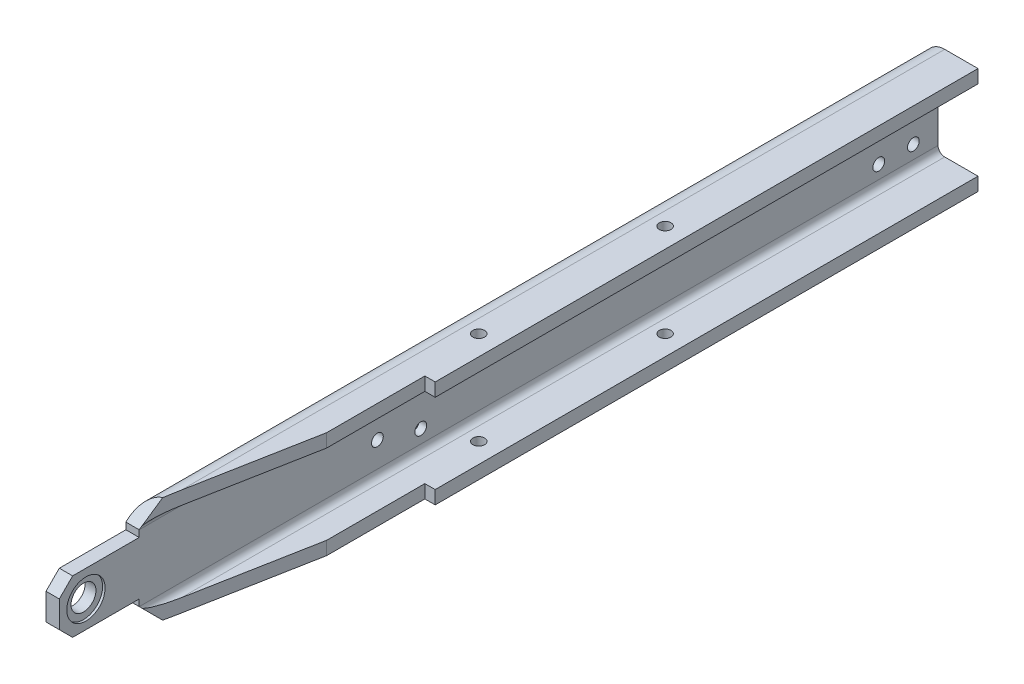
ISO-10303-21;
HEADER;
FILE_DESCRIPTION(('STEP AP214'),'2;1');
FILE_NAME('part.step','',(''),(''),'','','');
FILE_SCHEMA(('AUTOMOTIVE_DESIGN { 1 0 10303 214 1 1 1 1 }'));
ENDSEC;
DATA;
#1=APPLICATION_CONTEXT('core data for automotive mechanical design processes');
#2=APPLICATION_PROTOCOL_DEFINITION('international standard','automotive_design',2000,#1);
#3=PRODUCT_CONTEXT('',#1,'mechanical');
#4=PRODUCT('Part','Part','',(#3));
#5=PRODUCT_RELATED_PRODUCT_CATEGORY('part','',(#4));
#6=PRODUCT_DEFINITION_FORMATION('','',#4);
#7=PRODUCT_DEFINITION_CONTEXT('part definition',#1,'design');
#8=PRODUCT_DEFINITION('design','',#6,#7);
#9=PRODUCT_DEFINITION_SHAPE('','',#8);
#10=(LENGTH_UNIT() NAMED_UNIT(*) SI_UNIT(.MILLI.,.METRE.));
#11=(NAMED_UNIT(*) PLANE_ANGLE_UNIT() SI_UNIT($,.RADIAN.));
#12=(NAMED_UNIT(*) SI_UNIT($,.STERADIAN.) SOLID_ANGLE_UNIT());
#13=UNCERTAINTY_MEASURE_WITH_UNIT(LENGTH_MEASURE(1.E-05),#10,'distance_accuracy_value','');
#14=(GEOMETRIC_REPRESENTATION_CONTEXT(3) GLOBAL_UNCERTAINTY_ASSIGNED_CONTEXT((#13)) GLOBAL_UNIT_ASSIGNED_CONTEXT((#10,
#11,#12)) REPRESENTATION_CONTEXT('',''));
#15=CARTESIAN_POINT('',(0.,0.,0.));
#16=DIRECTION('',(0.,0.,1.));
#17=DIRECTION('',(1.,0.,0.));
#18=AXIS2_PLACEMENT_3D('',#15,#16,#17);
#19=CARTESIAN_POINT('',(-5.89805981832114E-12,0.,419.1));
#20=DIRECTION('',(1.,0.,0.));
#21=DIRECTION('',(0.,0.,-1.));
#22=AXIS2_PLACEMENT_3D('',#19,#20,#21);
#23=CYLINDRICAL_SURFACE('',#22,5.95312499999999);
#24=CARTESIAN_POINT('',(-5.89805981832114E-12,0.,419.1));
#25=DIRECTION('',(1.,0.,0.));
#26=DIRECTION('',(0.,0.,-1.));
#27=AXIS2_PLACEMENT_3D('',#24,#25,#26);
#28=CIRCLE('',#27,5.95312499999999);
#29=CARTESIAN_POINT('',(-5.89805981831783E-12,0.,413.146875));
#30=VERTEX_POINT('',#29);
#31=EDGE_CURVE('E296',#30,#30,#28,.T.);
#32=CARTESIAN_POINT('',(5.18159999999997,4.35481783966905E-13,419.1));
#33=DIRECTION('',(1.,0.,0.));
#34=DIRECTION('',(0.,0.,-1.));
#35=AXIS2_PLACEMENT_3D('',#32,#33,#34);
#36=CIRCLE('',#35,5.95312499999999);
#37=CARTESIAN_POINT('',(5.18159999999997,4.35481783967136E-13,413.146875));
#38=VERTEX_POINT('',#37);
#39=EDGE_CURVE('E260',#38,#38,#36,.F.);
#40=CARTESIAN_POINT('',(-5.89805981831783E-12,0.,413.146875));
#41=CARTESIAN_POINT('',(0.053974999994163,0.,413.146875));
#42=CARTESIAN_POINT('',(0.107949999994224,0.,413.146875));
#43=CARTESIAN_POINT('',(0.215899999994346,0.,413.146875));
#44=CARTESIAN_POINT('',(0.269874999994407,0.,413.146875));
#45=CARTESIAN_POINT('',(0.37782499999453,0.,413.146875));
#46=CARTESIAN_POINT('',(0.431799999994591,0.,413.146875));
#47=CARTESIAN_POINT('',(0.539749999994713,0.,413.146875));
#48=CARTESIAN_POINT('',(0.593724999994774,0.,413.146875));
#49=CARTESIAN_POINT('',(0.701674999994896,0.,413.146875));
#50=CARTESIAN_POINT('',(0.755649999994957,0.,413.146875));
#51=CARTESIAN_POINT('',(0.86359999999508,0.,413.146875));
#52=CARTESIAN_POINT('',(0.917574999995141,0.,413.146875));
#53=CARTESIAN_POINT('',(1.02552499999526,0.,413.146875));
#54=CARTESIAN_POINT('',(1.07949999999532,0.,413.146875));
#55=CARTESIAN_POINT('',(1.18744999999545,0.,413.146875));
#56=CARTESIAN_POINT('',(1.24142499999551,1.04334177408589E-13,413.146875));
#57=CARTESIAN_POINT('',(1.34937499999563,1.13406714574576E-13,413.146875));
#58=CARTESIAN_POINT('',(1.40334999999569,1.1794298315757E-13,413.146875));
#59=CARTESIAN_POINT('',(1.51129999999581,1.27015520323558E-13,413.146875));
#60=CARTESIAN_POINT('',(1.56527499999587,1.31551788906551E-13,413.146875));
#61=CARTESIAN_POINT('',(1.673224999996,1.40624326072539E-13,413.146875));
#62=CARTESIAN_POINT('',(1.72719999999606,1.45160594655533E-13,413.146875));
#63=CARTESIAN_POINT('',(1.83514999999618,1.5423313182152E-13,413.146875));
#64=CARTESIAN_POINT('',(1.88912499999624,1.58769400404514E-13,413.146875));
#65=CARTESIAN_POINT('',(1.99707499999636,1.67841937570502E-13,413.146875));
#66=CARTESIAN_POINT('',(2.05104999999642,1.72378206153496E-13,413.146875));
#67=CARTESIAN_POINT('',(2.15899999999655,1.81450743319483E-13,413.146875));
#68=CARTESIAN_POINT('',(2.21297499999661,1.85987011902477E-13,413.146875));
#69=CARTESIAN_POINT('',(2.32092499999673,1.95059549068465E-13,413.146875));
#70=CARTESIAN_POINT('',(2.37489999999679,1.99595817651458E-13,413.146875));
#71=CARTESIAN_POINT('',(2.48284999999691,2.08668354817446E-13,413.146875));
#72=CARTESIAN_POINT('',(2.53682499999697,2.1320462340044E-13,413.146875));
#73=CARTESIAN_POINT('',(2.6447749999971,2.22277160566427E-13,413.146875));
#74=CARTESIAN_POINT('',(2.69874999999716,2.26813429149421E-13,413.146875));
#75=CARTESIAN_POINT('',(2.80669999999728,2.35885966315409E-13,413.146875));
#76=CARTESIAN_POINT('',(2.86067499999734,2.40422234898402E-13,413.146875));
#77=CARTESIAN_POINT('',(2.96862499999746,2.4949477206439E-13,413.146875));
#78=CARTESIAN_POINT('',(3.02259999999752,2.54031040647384E-13,413.146875));
#79=CARTESIAN_POINT('',(3.13054999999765,2.63103577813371E-13,413.146875));
#80=CARTESIAN_POINT('',(3.18452499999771,2.67639846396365E-13,413.146875));
#81=CARTESIAN_POINT('',(3.29247499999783,2.76712383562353E-13,413.146875));
#82=CARTESIAN_POINT('',(3.34644999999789,2.81248652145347E-13,413.146875));
#83=CARTESIAN_POINT('',(3.45439999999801,2.90321189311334E-13,413.146875));
#84=CARTESIAN_POINT('',(3.50837499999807,2.94857457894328E-13,413.146875));
#85=CARTESIAN_POINT('',(3.6163249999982,3.03929995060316E-13,413.146875));
#86=CARTESIAN_POINT('',(3.67029999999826,3.08466263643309E-13,413.146875));
#87=CARTESIAN_POINT('',(3.77824999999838,3.17538800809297E-13,413.146875));
#88=CARTESIAN_POINT('',(3.83222499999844,3.22075069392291E-13,413.146875));
#89=CARTESIAN_POINT('',(3.94017499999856,3.31147606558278E-13,413.146875));
#90=CARTESIAN_POINT('',(3.99414999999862,3.35683875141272E-13,413.146875));
#91=CARTESIAN_POINT('',(4.10209999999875,3.4475641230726E-13,413.146875));
#92=CARTESIAN_POINT('',(4.15607499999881,3.49292680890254E-13,413.146875));
#93=CARTESIAN_POINT('',(4.26402499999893,3.58365218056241E-13,413.146875));
#94=CARTESIAN_POINT('',(4.31799999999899,3.62901486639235E-13,413.146875));
#95=CARTESIAN_POINT('',(4.42594999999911,3.71974023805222E-13,413.146875));
#96=CARTESIAN_POINT('',(4.47992499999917,3.76510292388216E-13,413.146875));
#97=CARTESIAN_POINT('',(4.5878749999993,3.85582829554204E-13,413.146875));
#98=CARTESIAN_POINT('',(4.64184999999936,3.90119098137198E-13,413.146875));
#99=CARTESIAN_POINT('',(4.74979999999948,3.99191635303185E-13,413.146875));
#100=CARTESIAN_POINT('',(4.80377499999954,4.03727903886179E-13,413.146875));
#101=CARTESIAN_POINT('',(4.91172499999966,4.12800441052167E-13,413.146875));
#102=CARTESIAN_POINT('',(4.96569999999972,4.1733670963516E-13,413.146875));
#103=CARTESIAN_POINT('',(5.07364999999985,4.26409246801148E-13,413.146875));
#104=CARTESIAN_POINT('',(5.12762499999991,4.30945515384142E-13,413.146875));
#105=CARTESIAN_POINT('',(5.18159999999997,4.35481783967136E-13,413.146875));
#106=B_SPLINE_CURVE_WITH_KNOTS('',3,(#40,#41,#42,#43,#44,#45,#46,#47,#48,#49,#50,#51,#52,#53,
#54,#55,#56,#57,#58,#59,#60,#61,#62,#63,#64,#65,#66,#67,#68,#69,#70,#71,#72,#73,#74,#75,#76,#77,
#78,#79,#80,#81,#82,#83,#84,#85,#86,#87,#88,#89,#90,#91,#92,#93,#94,#95,#96,#97,#98,#99,#100,
#101,#102,#103,#104,#105),.UNSPECIFIED.,.F.,.F.,(4,2,2,2,2,2,2,2,2,2,2,2,2,2,2,2,2,2,2,2,2,2,2,
2,2,2,2,2,2,2,2,2,4),(0.,0.161925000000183,0.323850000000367,0.48577500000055,0.647700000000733,
0.809625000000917,0.9715500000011,1.13347500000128,1.29540000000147,1.45732500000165,
1.61925000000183,1.78117500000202,1.9431000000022,2.10502500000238,2.26695000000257,
2.42887500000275,2.59080000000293,2.75272500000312,2.9146500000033,3.07657500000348,
3.23850000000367,3.40042500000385,3.56235000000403,3.72427500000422,3.8862000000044,
4.04812500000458,4.21005000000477,4.37197500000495,4.53390000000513,4.69582500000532,
4.8577500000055,5.01967500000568,5.18160000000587),.UNSPECIFIED.);
#107=EDGE_CURVE('BSEAM32',#30,#38,#106,.T.);
#108=ORIENTED_EDGE('',*,*,#31,.F.);
#109=ORIENTED_EDGE('',*,*,#39,.F.);
#110=ORIENTED_EDGE('',*,*,#107,.T.);
#111=ORIENTED_EDGE('',*,*,#107,.F.);
#112=EDGE_LOOP('',(#108,#110,#109,#111));
#113=FACE_BOUND('',#112,.T.);
#114=ADVANCED_FACE('F32',(#113),#23,.F.);
#115=CARTESIAN_POINT('',(9.5249999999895,-15.875,431.8));
#116=DIRECTION('',(0.,0.,-1.));
#117=DIRECTION('',(-1.,0.,0.));
#118=AXIS2_PLACEMENT_3D('',#115,#116,#117);
#119=CYLINDRICAL_SURFACE('',#118,9.525);
#120=DIRECTION('',(0.,0.,-1.));
#121=VECTOR('',#120,1.);
#122=CARTESIAN_POINT('',(-1.05054853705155E-11,-15.875,431.8));
#123=LINE('',#122,#121);
#124=CARTESIAN_POINT('',(-4.71844785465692E-12,-15.8750000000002,393.7));
#125=VERTEX_POINT('',#124);
#126=CARTESIAN_POINT('',(-1.05054853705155E-11,-15.8750000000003,12.7));
#127=VERTEX_POINT('',#126);
#128=EDGE_CURVE('E369',#125,#127,#123,.T.);
#129=ORIENTED_EDGE('',*,*,#128,.T.);
#130=CARTESIAN_POINT('',(9.5249999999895,-15.8750000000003,12.7));
#131=DIRECTION('',(0.,0.,1.));
#132=DIRECTION('',(1.,0.,0.));
#133=AXIS2_PLACEMENT_3D('',#130,#131,#132);
#134=CIRCLE('',#133,9.525);
#135=CARTESIAN_POINT('',(9.52499999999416,-25.4000000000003,12.7));
#136=VERTEX_POINT('',#135);
#137=EDGE_CURVE('E386',#127,#136,#134,.T.);
#138=ORIENTED_EDGE('',*,*,#137,.T.);
#139=DIRECTION('',(0.,0.,-1.));
#140=VECTOR('',#139,1.);
#141=CARTESIAN_POINT('',(9.5249999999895,-25.4,431.8));
#142=LINE('',#141,#140);
#143=CARTESIAN_POINT('',(9.52499999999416,-25.4,376.766666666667));
#144=VERTEX_POINT('',#143);
#145=EDGE_CURVE('E366',#144,#136,#142,.T.);
#146=ORIENTED_EDGE('',*,*,#145,.F.);
#147=CARTESIAN_POINT('',(9.5249999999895,-15.875,376.766666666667));
#148=DIRECTION('',(-0.982872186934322,0.,-0.184288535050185));
#149=DIRECTION('',(0.184288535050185,0.,-0.982872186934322));
#150=AXIS2_PLACEMENT_3D('',#147,#148,#149);
#151=ELLIPSE('',#150,51.6852553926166,9.525);
#152=CARTESIAN_POINT('',(8.11629759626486,-25.2952538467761,384.279746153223));
#153=VERTEX_POINT('',#152);
#154=EDGE_CURVE('E315',#144,#153,#151,.T.);
#155=ORIENTED_EDGE('',*,*,#154,.T.);
#156=CARTESIAN_POINT('',(9.52499999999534,-15.8750000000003,393.7));
#157=DIRECTION('',(0.,0.707106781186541,-0.707106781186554));
#158=DIRECTION('',(0.,-0.707106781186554,-0.707106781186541));
#159=AXIS2_PLACEMENT_3D('',#156,#157,#158);
#160=ELLIPSE('',#159,13.4703841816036,9.525);
#161=EDGE_CURVE('E423',#153,#125,#160,.T.);
#162=ORIENTED_EDGE('',*,*,#161,.T.);
#163=EDGE_LOOP('',(#129,#138,#146,#155,#162));
#164=FACE_BOUND('',#163,.T.);
#165=ADVANCED_FACE('F525',(#164),#119,.T.);
#166=CARTESIAN_POINT('',(9.5249999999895,-25.4,431.8));
#167=DIRECTION('',(0.,1.,0.));
#168=DIRECTION('',(-1.,0.,0.));
#169=AXIS2_PLACEMENT_3D('',#166,#167,#168);
#170=PLANE('',#169);
#171=CARTESIAN_POINT('',(15.8749999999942,-25.3999999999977,152.4));
#172=DIRECTION('',(0.,-1.,0.));
#173=DIRECTION('',(1.,0.,0.));
#174=AXIS2_PLACEMENT_3D('',#171,#172,#173);
#175=CIRCLE('',#174,2.79400000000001);
#176=CARTESIAN_POINT('',(18.6689999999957,-25.3999999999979,152.4));
#177=VERTEX_POINT('',#176);
#178=EDGE_CURVE('E263',#177,#177,#175,.T.);
#179=ORIENTED_EDGE('',*,*,#178,.F.);
#180=EDGE_LOOP('',(#179));
#181=FACE_BOUND('',#180,.T.);
#182=CARTESIAN_POINT('',(15.8749999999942,-25.3999999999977,241.3));
#183=DIRECTION('',(0.,-1.,0.));
#184=DIRECTION('',(1.,0.,0.));
#185=AXIS2_PLACEMENT_3D('',#182,#183,#184);
#186=CIRCLE('',#185,2.794);
#187=CARTESIAN_POINT('',(18.6689999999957,-25.3999999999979,241.3));
#188=VERTEX_POINT('',#187);
#189=EDGE_CURVE('E410',#188,#188,#186,.T.);
#190=ORIENTED_EDGE('',*,*,#189,.F.);
#191=EDGE_LOOP('',(#190));
#192=FACE_BOUND('',#191,.T.);
#193=DIRECTION('',(-1.,0.,0.));
#194=VECTOR('',#193,1.);
#195=CARTESIAN_POINT('',(25.3999999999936,-25.4000000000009,271.578943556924));
#196=LINE('',#195,#194);
#197=CARTESIAN_POINT('',(25.3999999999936,-25.4000000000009,271.578943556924));
#198=VERTEX_POINT('',#197);
#199=CARTESIAN_POINT('',(20.4690797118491,-25.400000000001,271.578943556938));
#200=VERTEX_POINT('',#199);
#201=EDGE_CURVE('E505',#198,#200,#196,.T.);
#202=ORIENTED_EDGE('',*,*,#201,.T.);
#203=DIRECTION('',(0.,0.,1.));
#204=VECTOR('',#203,1.);
#205=CARTESIAN_POINT('',(20.4690797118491,-25.400000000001,271.578943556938));
#206=LINE('',#205,#204);
#207=CARTESIAN_POINT('',(20.4690797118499,-25.400000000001,318.398241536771));
#208=VERTEX_POINT('',#207);
#209=EDGE_CURVE('E203',#200,#208,#206,.T.);
#210=ORIENTED_EDGE('',*,*,#209,.T.);
#211=DIRECTION('',(-0.184288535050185,0.,0.982872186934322));
#212=VECTOR('',#211,1.);
#213=CARTESIAN_POINT('',(6.34999999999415,-25.3999999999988,393.7));
#214=LINE('',#213,#212);
#215=EDGE_CURVE('E295',#208,#144,#214,.T.);
#216=ORIENTED_EDGE('',*,*,#215,.T.);
#217=ORIENTED_EDGE('',*,*,#145,.T.);
#218=DIRECTION('',(1.,0.,0.));
#219=VECTOR('',#218,1.);
#220=CARTESIAN_POINT('',(-5.84254866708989E-12,-25.4000000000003,12.7));
#221=LINE('',#220,#219);
#222=CARTESIAN_POINT('',(25.399999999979,-25.3999999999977,12.6999999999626));
#223=VERTEX_POINT('',#222);
#224=EDGE_CURVE('E459',#136,#223,#221,.T.);
#225=ORIENTED_EDGE('',*,*,#224,.T.);
#226=DIRECTION('',(0.,0.,-1.));
#227=VECTOR('',#226,1.);
#228=CARTESIAN_POINT('',(25.3999999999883,-25.3999999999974,431.8));
#229=LINE('',#228,#227);
#230=EDGE_CURVE('E364',#198,#223,#229,.T.);
#231=ORIENTED_EDGE('',*,*,#230,.F.);
#232=EDGE_LOOP('',(#202,#210,#216,#217,#225,#231));
#233=FACE_BOUND('',#232,.T.);
#234=ADVANCED_FACE('F510',(#181,#192,#233),#170,.F.);
#235=CARTESIAN_POINT('',(25.3999999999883,-19.0499999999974,431.8));
#236=DIRECTION('',(-1.,0.,0.));
#237=DIRECTION('',(0.,0.,1.));
#238=AXIS2_PLACEMENT_3D('',#235,#236,#237);
#239=PLANE('',#238);
#240=DIRECTION('',(0.,0.,-1.));
#241=VECTOR('',#240,1.);
#242=CARTESIAN_POINT('',(25.3999999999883,-19.0499999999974,431.8));
#243=LINE('',#242,#241);
#244=CARTESIAN_POINT('',(25.399999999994,-19.0499999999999,271.578943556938));
#245=VERTEX_POINT('',#244);
#246=CARTESIAN_POINT('',(25.399999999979,-19.0499999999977,12.7000000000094));
#247=VERTEX_POINT('',#246);
#248=EDGE_CURVE('E362',#245,#247,#243,.T.);
#249=ORIENTED_EDGE('',*,*,#248,.F.);
#250=DIRECTION('',(0.,1.,0.));
#251=VECTOR('',#250,1.);
#252=CARTESIAN_POINT('',(25.3999999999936,-25.4000000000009,271.578943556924));
#253=LINE('',#252,#251);
#254=EDGE_CURVE('E202',#198,#245,#253,.T.);
#255=ORIENTED_EDGE('',*,*,#254,.F.);
#256=ORIENTED_EDGE('',*,*,#230,.T.);
#257=DIRECTION('',(0.,1.,0.));
#258=VECTOR('',#257,1.);
#259=CARTESIAN_POINT('',(25.399999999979,-25.3999999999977,12.6999999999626));
#260=LINE('',#259,#258);
#261=EDGE_CURVE('E455',#223,#247,#260,.T.);
#262=ORIENTED_EDGE('',*,*,#261,.T.);
#263=EDGE_LOOP('',(#249,#255,#256,#262));
#264=FACE_BOUND('',#263,.T.);
#265=ADVANCED_FACE('F518',(#264),#239,.F.);
#266=CARTESIAN_POINT('',(9.5249999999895,-19.05,431.8));
#267=DIRECTION('',(0.,-1.,0.));
#268=DIRECTION('',(1.,0.,0.));
#269=AXIS2_PLACEMENT_3D('',#266,#267,#268);
#270=PLANE('',#269);
#271=CARTESIAN_POINT('',(15.8749999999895,-19.0499999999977,152.4));
#272=DIRECTION('',(0.,-1.,0.));
#273=DIRECTION('',(1.,0.,0.));
#274=AXIS2_PLACEMENT_3D('',#271,#272,#273);
#275=CIRCLE('',#274,2.79400000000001);
#276=CARTESIAN_POINT('',(18.6689999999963,-19.0499999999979,152.4));
#277=VERTEX_POINT('',#276);
#278=EDGE_CURVE('E258',#277,#277,#275,.T.);
#279=ORIENTED_EDGE('',*,*,#278,.T.);
#280=EDGE_LOOP('',(#279));
#281=FACE_BOUND('',#280,.T.);
#282=CARTESIAN_POINT('',(15.8749999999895,-19.0499999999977,241.3));
#283=DIRECTION('',(0.,-1.,0.));
#284=DIRECTION('',(1.,0.,0.));
#285=AXIS2_PLACEMENT_3D('',#282,#283,#284);
#286=CIRCLE('',#285,2.794);
#287=CARTESIAN_POINT('',(18.6689999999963,-19.0499999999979,241.3));
#288=VERTEX_POINT('',#287);
#289=EDGE_CURVE('E253',#288,#288,#286,.T.);
#290=ORIENTED_EDGE('',*,*,#289,.T.);
#291=EDGE_LOOP('',(#290));
#292=FACE_BOUND('',#291,.T.);
#293=DIRECTION('',(0.184288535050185,0.,-0.982872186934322));
#294=VECTOR('',#293,1.);
#295=CARTESIAN_POINT('',(-0.443301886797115,-19.0500000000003,429.930943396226));
#296=LINE('',#295,#294);
#297=CARTESIAN_POINT('',(9.5249999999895,-19.05,376.766666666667));
#298=VERTEX_POINT('',#297);
#299=CARTESIAN_POINT('',(20.4690797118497,-19.0499999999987,318.398241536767));
#300=VERTEX_POINT('',#299);
#301=EDGE_CURVE('E312',#298,#300,#296,.T.);
#302=ORIENTED_EDGE('',*,*,#301,.T.);
#303=DIRECTION('',(0.,0.,-1.));
#304=VECTOR('',#303,1.);
#305=CARTESIAN_POINT('',(20.4690797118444,-19.0500000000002,431.8));
#306=LINE('',#305,#304);
#307=CARTESIAN_POINT('',(20.4690797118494,-19.0500000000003,271.578943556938));
#308=VERTEX_POINT('',#307);
#309=EDGE_CURVE('E47',#300,#308,#306,.T.);
#310=ORIENTED_EDGE('',*,*,#309,.T.);
#311=DIRECTION('',(1.,0.,0.));
#312=VECTOR('',#311,1.);
#313=CARTESIAN_POINT('',(9.5249999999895,-19.05,271.578943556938));
#314=LINE('',#313,#312);
#315=EDGE_CURVE('E492',#308,#245,#314,.T.);
#316=ORIENTED_EDGE('',*,*,#315,.T.);
#317=ORIENTED_EDGE('',*,*,#248,.T.);
#318=DIRECTION('',(-1.,0.,0.));
#319=VECTOR('',#318,1.);
#320=CARTESIAN_POINT('',(9.52499999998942,-19.0500000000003,12.7));
#321=LINE('',#320,#319);
#322=CARTESIAN_POINT('',(9.5249999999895,-19.0500000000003,12.7));
#323=VERTEX_POINT('',#322);
#324=EDGE_CURVE('E392',#247,#323,#321,.T.);
#325=ORIENTED_EDGE('',*,*,#324,.T.);
#326=DIRECTION('',(0.,0.,-1.));
#327=VECTOR('',#326,1.);
#328=CARTESIAN_POINT('',(9.5249999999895,-19.05,431.8));
#329=LINE('',#328,#327);
#330=EDGE_CURVE('E359',#298,#323,#329,.T.);
#331=ORIENTED_EDGE('',*,*,#330,.F.);
#332=EDGE_LOOP('',(#302,#310,#316,#317,#325,#331));
#333=FACE_BOUND('',#332,.T.);
#334=ADVANCED_FACE('F521',(#281,#292,#333),#270,.F.);
#335=CARTESIAN_POINT('',(9.5249999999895,-15.875,431.8));
#336=DIRECTION('',(0.,0.,-1.));
#337=DIRECTION('',(-1.,0.,0.));
#338=AXIS2_PLACEMENT_3D('',#335,#336,#337);
#339=CYLINDRICAL_SURFACE('',#338,3.175);
#340=ORIENTED_EDGE('',*,*,#330,.T.);
#341=CARTESIAN_POINT('',(9.5249999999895,-15.8750000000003,12.7));
#342=DIRECTION('',(0.,0.,1.));
#343=DIRECTION('',(1.,0.,0.));
#344=AXIS2_PLACEMENT_3D('',#341,#342,#343);
#345=CIRCLE('',#344,3.175);
#346=CARTESIAN_POINT('',(6.34999999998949,-15.8749999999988,12.7));
#347=VERTEX_POINT('',#346);
#348=EDGE_CURVE('E448',#323,#347,#345,.F.);
#349=ORIENTED_EDGE('',*,*,#348,.T.);
#350=DIRECTION('',(0.,0.,-1.));
#351=VECTOR('',#350,1.);
#352=CARTESIAN_POINT('',(6.34999999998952,-15.8749999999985,431.8));
#353=LINE('',#352,#351);
#354=CARTESIAN_POINT('',(6.34999999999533,-15.8749999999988,393.7));
#355=VERTEX_POINT('',#354);
#356=EDGE_CURVE('E356',#355,#347,#353,.T.);
#357=ORIENTED_EDGE('',*,*,#356,.F.);
#358=CARTESIAN_POINT('',(9.52499999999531,-15.8750000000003,393.7));
#359=DIRECTION('',(0.,0.707106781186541,-0.707106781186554));
#360=DIRECTION('',(0.,-0.707106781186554,-0.707106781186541));
#361=AXIS2_PLACEMENT_3D('',#358,#359,#360);
#362=ELLIPSE('',#361,4.49012806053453,3.175);
#363=CARTESIAN_POINT('',(6.565660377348,-17.0251886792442,392.549811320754));
#364=VERTEX_POINT('',#363);
#365=EDGE_CURVE('E420',#355,#364,#362,.F.);
#366=ORIENTED_EDGE('',*,*,#365,.T.);
#367=CARTESIAN_POINT('',(9.5249999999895,-15.875,376.766666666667));
#368=DIRECTION('',(-0.982872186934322,0.,-0.184288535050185));
#369=DIRECTION('',(0.184288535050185,0.,-0.982872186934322));
#370=AXIS2_PLACEMENT_3D('',#367,#368,#369);
#371=ELLIPSE('',#370,17.2284184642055,3.175);
#372=EDGE_CURVE('E310',#364,#298,#371,.F.);
#373=ORIENTED_EDGE('',*,*,#372,.T.);
#374=EDGE_LOOP('',(#340,#349,#357,#366,#373));
#375=FACE_BOUND('',#374,.T.);
#376=ADVANCED_FACE('F452',(#375),#339,.F.);
#377=CARTESIAN_POINT('',(25.4,25.4000000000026,431.8));
#378=DIRECTION('',(-1.,0.,0.));
#379=DIRECTION('',(0.,0.,1.));
#380=AXIS2_PLACEMENT_3D('',#377,#378,#379);
#381=PLANE('',#380);
#382=DIRECTION('',(0.,0.,-1.));
#383=VECTOR('',#382,1.);
#384=CARTESIAN_POINT('',(25.4,25.4000000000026,431.8));
#385=LINE('',#384,#383);
#386=CARTESIAN_POINT('',(25.4000000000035,25.4,271.578943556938));
#387=VERTEX_POINT('',#386);
#388=CARTESIAN_POINT('',(25.4,25.4000000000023,12.7));
#389=VERTEX_POINT('',#388);
#390=EDGE_CURVE('E209',#387,#389,#385,.T.);
#391=ORIENTED_EDGE('',*,*,#390,.F.);
#392=CARTESIAN_POINT('',(25.3999999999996,19.0500000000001,271.578943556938));
#393=VERTEX_POINT('',#392);
#394=EDGE_CURVE('E194',#393,#387,#253,.T.);
#395=ORIENTED_EDGE('',*,*,#394,.F.);
#396=DIRECTION('',(0.,0.,-1.));
#397=VECTOR('',#396,1.);
#398=CARTESIAN_POINT('',(25.4,19.0500000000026,431.8));
#399=LINE('',#398,#397);
#400=CARTESIAN_POINT('',(25.4,19.0500000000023,12.7));
#401=VERTEX_POINT('',#400);
#402=EDGE_CURVE('E348',#393,#401,#399,.T.);
#403=ORIENTED_EDGE('',*,*,#402,.T.);
#404=EDGE_CURVE('E214',#401,#389,#260,.T.);
#405=ORIENTED_EDGE('',*,*,#404,.T.);
#406=EDGE_LOOP('',(#391,#395,#403,#405));
#407=FACE_BOUND('',#406,.T.);
#408=ADVANCED_FACE('F34',(#407),#381,.F.);
#409=CARTESIAN_POINT('',(9.52499999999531,25.4,431.8));
#410=DIRECTION('',(0.,-1.,0.));
#411=DIRECTION('',(1.,0.,0.));
#412=AXIS2_PLACEMENT_3D('',#409,#410,#411);
#413=PLANE('',#412);
#414=CARTESIAN_POINT('',(15.875,25.4000000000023,152.4));
#415=DIRECTION('',(0.,-1.,0.));
#416=DIRECTION('',(1.,0.,0.));
#417=AXIS2_PLACEMENT_3D('',#414,#415,#416);
#418=CIRCLE('',#417,2.79400000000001);
#419=CARTESIAN_POINT('',(18.669,25.4000000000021,152.4));
#420=VERTEX_POINT('',#419);
#421=EDGE_CURVE('E259',#420,#420,#418,.T.);
#422=ORIENTED_EDGE('',*,*,#421,.T.);
#423=EDGE_LOOP('',(#422));
#424=FACE_BOUND('',#423,.T.);
#425=CARTESIAN_POINT('',(15.875,25.4000000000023,241.3));
#426=DIRECTION('',(0.,-1.,0.));
#427=DIRECTION('',(1.,0.,0.));
#428=AXIS2_PLACEMENT_3D('',#425,#426,#427);
#429=CIRCLE('',#428,2.794);
#430=CARTESIAN_POINT('',(18.669,25.4000000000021,241.3));
#431=VERTEX_POINT('',#430);
#432=EDGE_CURVE('E254',#431,#431,#429,.T.);
#433=ORIENTED_EDGE('',*,*,#432,.T.);
#434=EDGE_LOOP('',(#433));
#435=FACE_BOUND('',#434,.T.);
#436=DIRECTION('',(-0.184288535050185,0.,0.982872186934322));
#437=VECTOR('',#436,1.);
#438=CARTESIAN_POINT('',(6.35000000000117,25.4000000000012,393.7));
#439=LINE('',#438,#437);
#440=CARTESIAN_POINT('',(20.4690797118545,25.400000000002,318.398241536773));
#441=VERTEX_POINT('',#440);
#442=CARTESIAN_POINT('',(9.52499999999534,25.4,376.766666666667));
#443=VERTEX_POINT('',#442);
#444=EDGE_CURVE('E289',#441,#443,#439,.T.);
#445=ORIENTED_EDGE('',*,*,#444,.F.);
#446=DIRECTION('',(0.,0.,1.));
#447=VECTOR('',#446,1.);
#448=CARTESIAN_POINT('',(20.4690797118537,25.3999999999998,271.578943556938));
#449=LINE('',#448,#447);
#450=CARTESIAN_POINT('',(20.4690797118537,25.3999999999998,271.578943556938));
#451=VERTEX_POINT('',#450);
#452=EDGE_CURVE('E55',#451,#441,#449,.T.);
#453=ORIENTED_EDGE('',*,*,#452,.F.);
#454=DIRECTION('',(-1.,0.,0.));
#455=VECTOR('',#454,1.);
#456=CARTESIAN_POINT('',(25.4000000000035,25.4,271.578943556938));
#457=LINE('',#456,#455);
#458=EDGE_CURVE('E198',#387,#451,#457,.T.);
#459=ORIENTED_EDGE('',*,*,#458,.F.);
#460=ORIENTED_EDGE('',*,*,#390,.T.);
#461=DIRECTION('',(1.,0.,0.));
#462=VECTOR('',#461,1.);
#463=CARTESIAN_POINT('',(-4.66293670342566E-12,25.3999999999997,12.7000000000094));
#464=LINE('',#463,#462);
#465=CARTESIAN_POINT('',(9.52499999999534,25.3999999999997,12.6999999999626));
#466=VERTEX_POINT('',#465);
#467=EDGE_CURVE('E279',#466,#389,#464,.T.);
#468=ORIENTED_EDGE('',*,*,#467,.F.);
#469=DIRECTION('',(0.,0.,-1.));
#470=VECTOR('',#469,1.);
#471=CARTESIAN_POINT('',(9.52499999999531,25.4,431.8));
#472=LINE('',#471,#470);
#473=EDGE_CURVE('E216',#443,#466,#472,.T.);
#474=ORIENTED_EDGE('',*,*,#473,.F.);
#475=EDGE_LOOP('',(#445,#453,#459,#460,#468,#474));
#476=FACE_BOUND('',#475,.T.);
#477=ADVANCED_FACE('F207',(#424,#435,#476),#413,.F.);
#478=CARTESIAN_POINT('',(9.52499999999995,15.875,431.8));
#479=DIRECTION('',(0.,0.,-1.));
#480=DIRECTION('',(-1.,0.,0.));
#481=AXIS2_PLACEMENT_3D('',#478,#479,#480);
#482=CYLINDRICAL_SURFACE('',#481,9.525);
#483=ORIENTED_EDGE('',*,*,#473,.T.);
#484=CARTESIAN_POINT('',(9.52500000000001,15.8749999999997,12.6999999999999));
#485=DIRECTION('',(0.,0.,1.));
#486=DIRECTION('',(1.,0.,0.));
#487=AXIS2_PLACEMENT_3D('',#484,#485,#486);
#488=CIRCLE('',#487,9.525);
#489=CARTESIAN_POINT('',(0.,15.8749999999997,12.6999999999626));
#490=VERTEX_POINT('',#489);
#491=EDGE_CURVE('E384',#466,#490,#488,.T.);
#492=ORIENTED_EDGE('',*,*,#491,.T.);
#493=DIRECTION('',(0.,0.,-1.));
#494=VECTOR('',#493,1.);
#495=CARTESIAN_POINT('',(0.,15.875,431.8));
#496=LINE('',#495,#494);
#497=CARTESIAN_POINT('',(0.,15.8749999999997,393.7));
#498=VERTEX_POINT('',#497);
#499=EDGE_CURVE('E222',#498,#490,#496,.T.);
#500=ORIENTED_EDGE('',*,*,#499,.F.);
#501=CARTESIAN_POINT('',(9.52500000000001,15.8749999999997,393.7));
#502=DIRECTION('',(0.,-0.707106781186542,-0.707106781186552));
#503=DIRECTION('',(0.,0.707106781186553,-0.707106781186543));
#504=AXIS2_PLACEMENT_3D('',#501,#502,#503);
#505=ELLIPSE('',#504,13.4703841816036,9.525);
#506=CARTESIAN_POINT('',(8.11629759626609,25.295253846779,384.279746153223));
#507=VERTEX_POINT('',#506);
#508=EDGE_CURVE('E300',#498,#507,#505,.T.);
#509=ORIENTED_EDGE('',*,*,#508,.T.);
#510=CARTESIAN_POINT('',(9.52500000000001,15.875,376.766666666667));
#511=DIRECTION('',(-0.982872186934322,0.,-0.184288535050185));
#512=DIRECTION('',(0.184288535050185,0.,-0.982872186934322));
#513=AXIS2_PLACEMENT_3D('',#510,#511,#512);
#514=ELLIPSE('',#513,51.6852553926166,9.525);
#515=EDGE_CURVE('E308',#507,#443,#514,.T.);
#516=ORIENTED_EDGE('',*,*,#515,.T.);
#517=EDGE_LOOP('',(#483,#492,#500,#509,#516));
#518=FACE_BOUND('',#517,.T.);
#519=ADVANCED_FACE('F383',(#518),#482,.T.);
#520=CARTESIAN_POINT('',(9.52499999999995,15.875,431.8));
#521=DIRECTION('',(0.,0.,-1.));
#522=DIRECTION('',(-1.,0.,0.));
#523=AXIS2_PLACEMENT_3D('',#520,#521,#522);
#524=CYLINDRICAL_SURFACE('',#523,3.175);
#525=DIRECTION('',(0.,0.,-1.));
#526=VECTOR('',#525,1.);
#527=CARTESIAN_POINT('',(6.34999999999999,15.8750000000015,431.8));
#528=LINE('',#527,#526);
#529=CARTESIAN_POINT('',(6.34999999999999,15.8750000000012,393.7));
#530=VERTEX_POINT('',#529);
#531=CARTESIAN_POINT('',(6.34999999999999,15.8750000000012,12.6999999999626));
#532=VERTEX_POINT('',#531);
#533=EDGE_CURVE('E353',#530,#532,#528,.T.);
#534=ORIENTED_EDGE('',*,*,#533,.T.);
#535=CARTESIAN_POINT('',(9.52500000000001,15.8749999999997,12.6999999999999));
#536=DIRECTION('',(0.,0.,1.));
#537=DIRECTION('',(1.,0.,0.));
#538=AXIS2_PLACEMENT_3D('',#535,#536,#537);
#539=CIRCLE('',#538,3.175);
#540=CARTESIAN_POINT('',(9.52500000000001,19.0499999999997,12.6999999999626));
#541=VERTEX_POINT('',#540);
#542=EDGE_CURVE('E450',#532,#541,#539,.F.);
#543=ORIENTED_EDGE('',*,*,#542,.T.);
#544=DIRECTION('',(0.,0.,-1.));
#545=VECTOR('',#544,1.);
#546=CARTESIAN_POINT('',(9.52499999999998,19.05,431.8));
#547=LINE('',#546,#545);
#548=CARTESIAN_POINT('',(9.52500000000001,19.05,376.766666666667));
#549=VERTEX_POINT('',#548);
#550=EDGE_CURVE('E350',#549,#541,#547,.T.);
#551=ORIENTED_EDGE('',*,*,#550,.F.);
#552=CARTESIAN_POINT('',(9.52500000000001,15.875,376.766666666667));
#553=DIRECTION('',(-0.982872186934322,0.,-0.184288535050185));
#554=DIRECTION('',(0.184288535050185,0.,-0.982872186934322));
#555=AXIS2_PLACEMENT_3D('',#552,#553,#554);
#556=ELLIPSE('',#555,17.2284184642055,3.175);
#557=CARTESIAN_POINT('',(6.56566037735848,17.0251886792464,392.549811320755));
#558=VERTEX_POINT('',#557);
#559=EDGE_CURVE('E305',#549,#558,#556,.F.);
#560=ORIENTED_EDGE('',*,*,#559,.T.);
#561=CARTESIAN_POINT('',(9.52500000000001,15.8749999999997,393.7));
#562=DIRECTION('',(0.,-0.707106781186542,-0.707106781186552));
#563=DIRECTION('',(0.,0.707106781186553,-0.707106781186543));
#564=AXIS2_PLACEMENT_3D('',#561,#562,#563);
#565=ELLIPSE('',#564,4.49012806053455,3.175);
#566=EDGE_CURVE('E428',#558,#530,#565,.F.);
#567=ORIENTED_EDGE('',*,*,#566,.T.);
#568=EDGE_LOOP('',(#534,#543,#551,#560,#567));
#569=FACE_BOUND('',#568,.T.);
#570=ADVANCED_FACE('F431',(#569),#524,.F.);
#571=CARTESIAN_POINT('',(9.52499999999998,19.05,431.8));
#572=DIRECTION('',(0.,1.,0.));
#573=DIRECTION('',(0.,0.,1.));
#574=AXIS2_PLACEMENT_3D('',#571,#572,#573);
#575=PLANE('',#574);
#576=CARTESIAN_POINT('',(15.875,19.0500000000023,152.4));
#577=DIRECTION('',(0.,1.,0.));
#578=DIRECTION('',(0.,0.,1.));
#579=AXIS2_PLACEMENT_3D('',#576,#577,#578);
#580=CIRCLE('',#579,2.79400000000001);
#581=CARTESIAN_POINT('',(18.6689999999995,19.0500000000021,152.4));
#582=VERTEX_POINT('',#581);
#583=EDGE_CURVE('E255',#582,#582,#580,.T.);
#584=ORIENTED_EDGE('',*,*,#583,.T.);
#585=EDGE_LOOP('',(#584));
#586=FACE_BOUND('',#585,.T.);
#587=CARTESIAN_POINT('',(15.875,19.0500000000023,241.3));
#588=DIRECTION('',(0.,1.,0.));
#589=DIRECTION('',(0.,0.,1.));
#590=AXIS2_PLACEMENT_3D('',#587,#588,#589);
#591=CIRCLE('',#590,2.794);
#592=CARTESIAN_POINT('',(18.6689999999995,19.0500000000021,241.3));
#593=VERTEX_POINT('',#592);
#594=EDGE_CURVE('E250',#593,#593,#591,.T.);
#595=ORIENTED_EDGE('',*,*,#594,.T.);
#596=EDGE_LOOP('',(#595));
#597=FACE_BOUND('',#596,.T.);
#598=DIRECTION('',(-1.,0.,0.));
#599=VECTOR('',#598,1.);
#600=CARTESIAN_POINT('',(9.52499999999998,19.05,271.578943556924));
#601=LINE('',#600,#599);
#602=CARTESIAN_POINT('',(20.469079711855,19.0499999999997,271.578943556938));
#603=VERTEX_POINT('',#602);
#604=EDGE_CURVE('E11',#393,#603,#601,.T.);
#605=ORIENTED_EDGE('',*,*,#604,.T.);
#606=DIRECTION('',(0.,0.,1.));
#607=VECTOR('',#606,1.);
#608=CARTESIAN_POINT('',(20.4690797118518,19.0499999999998,431.8));
#609=LINE('',#608,#607);
#610=CARTESIAN_POINT('',(20.4690797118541,19.0500000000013,318.398241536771));
#611=VERTEX_POINT('',#610);
#612=EDGE_CURVE('E496',#603,#611,#609,.T.);
#613=ORIENTED_EDGE('',*,*,#612,.T.);
#614=DIRECTION('',(-0.184288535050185,0.,0.982872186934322));
#615=VECTOR('',#614,1.);
#616=CARTESIAN_POINT('',(-0.443301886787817,19.0499999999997,429.930943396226));
#617=LINE('',#616,#615);
#618=EDGE_CURVE('E292',#611,#549,#617,.T.);
#619=ORIENTED_EDGE('',*,*,#618,.T.);
#620=ORIENTED_EDGE('',*,*,#550,.T.);
#621=DIRECTION('',(1.,0.,0.));
#622=VECTOR('',#621,1.);
#623=CARTESIAN_POINT('',(9.52499999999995,19.0499999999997,12.6999999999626));
#624=LINE('',#623,#622);
#625=EDGE_CURVE('E387',#541,#401,#624,.T.);
#626=ORIENTED_EDGE('',*,*,#625,.T.);
#627=ORIENTED_EDGE('',*,*,#402,.F.);
#628=EDGE_LOOP('',(#605,#613,#619,#620,#626,#627));
#629=FACE_BOUND('',#628,.T.);
#630=ADVANCED_FACE('F897',(#586,#597,#629),#575,.F.);
#631=CARTESIAN_POINT('',(-1.05054853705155E-11,-15.875,431.8));
#632=DIRECTION('',(1.,0.,0.));
#633=DIRECTION('',(0.,0.,-1.));
#634=AXIS2_PLACEMENT_3D('',#631,#632,#633);
#635=PLANE('',#634);
#636=CARTESIAN_POINT('',(-5.89805981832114E-12,9.525,40.9792445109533));
#637=DIRECTION('',(1.,0.,0.));
#638=DIRECTION('',(0.,1.,0.));
#639=AXIS2_PLACEMENT_3D('',#636,#637,#638);
#640=CIRCLE('',#639,2.8067);
#641=CARTESIAN_POINT('',(-6.13394578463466E-12,12.3317,40.9792445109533));
#642=VERTEX_POINT('',#641);
#643=EDGE_CURVE('E486',#642,#642,#640,.T.);
#644=ORIENTED_EDGE('',*,*,#643,.T.);
#645=EDGE_LOOP('',(#644));
#646=FACE_BOUND('',#645,.T.);
#647=CARTESIAN_POINT('',(-5.89805981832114E-12,-9.52500000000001,40.9792445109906));
#648=DIRECTION('',(1.,0.,0.));
#649=DIRECTION('',(0.,1.,0.));
#650=AXIS2_PLACEMENT_3D('',#647,#648,#649);
#651=CIRCLE('',#650,2.8067);
#652=CARTESIAN_POINT('',(-6.13394578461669E-12,-6.7183,40.9792445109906));
#653=VERTEX_POINT('',#652);
#654=EDGE_CURVE('E480',#653,#653,#651,.T.);
#655=ORIENTED_EDGE('',*,*,#654,.T.);
#656=EDGE_LOOP('',(#655));
#657=FACE_BOUND('',#656,.T.);
#658=CARTESIAN_POINT('',(-4.66293670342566E-12,-3.80999999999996,280.0985));
#659=DIRECTION('',(1.,0.,0.));
#660=DIRECTION('',(0.,0.,-1.));
#661=AXIS2_PLACEMENT_3D('',#658,#659,#660);
#662=CIRCLE('',#661,2.80670000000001);
#663=CARTESIAN_POINT('',(-4.66293670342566E-12,-3.80999999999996,277.2918));
#664=VERTEX_POINT('',#663);
#665=EDGE_CURVE('E474',#664,#664,#662,.T.);
#666=ORIENTED_EDGE('',*,*,#665,.T.);
#667=EDGE_LOOP('',(#666));
#668=FACE_BOUND('',#667,.T.);
#669=CARTESIAN_POINT('',(0.,-9.525,259.419244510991));
#670=DIRECTION('',(-1.,0.,0.));
#671=DIRECTION('',(0.,0.,1.));
#672=AXIS2_PLACEMENT_3D('',#669,#670,#671);
#673=CIRCLE('',#672,5.2197);
#674=CARTESIAN_POINT('',(0.,-9.525,264.638944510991));
#675=VERTEX_POINT('',#674);
#676=EDGE_CURVE('E471',#675,#675,#673,.T.);
#677=ORIENTED_EDGE('',*,*,#676,.F.);
#678=EDGE_LOOP('',(#677));
#679=FACE_BOUND('',#678,.T.);
#680=CARTESIAN_POINT('',(0.,9.525,259.419244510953));
#681=DIRECTION('',(-1.,0.,0.));
#682=DIRECTION('',(0.,0.,1.));
#683=AXIS2_PLACEMENT_3D('',#680,#681,#682);
#684=CIRCLE('',#683,5.2197);
#685=CARTESIAN_POINT('',(0.,9.525,264.638944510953));
#686=VERTEX_POINT('',#685);
#687=EDGE_CURVE('E283',#686,#686,#684,.T.);
#688=ORIENTED_EDGE('',*,*,#687,.F.);
#689=EDGE_LOOP('',(#688));
#690=FACE_BOUND('',#689,.T.);
#691=CARTESIAN_POINT('',(-5.84254866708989E-12,-9.52500000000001,24.4692445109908));
#692=DIRECTION('',(-1.,0.,0.));
#693=DIRECTION('',(0.,0.,1.));
#694=AXIS2_PLACEMENT_3D('',#691,#692,#693);
#695=CIRCLE('',#694,2.79400000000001);
#696=CARTESIAN_POINT('',(-5.83907922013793E-12,-9.5250000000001,27.2632445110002));
#697=VERTEX_POINT('',#696);
#698=EDGE_CURVE('E273',#697,#697,#695,.T.);
#699=ORIENTED_EDGE('',*,*,#698,.F.);
#700=EDGE_LOOP('',(#699));
#701=FACE_BOUND('',#700,.T.);
#702=CARTESIAN_POINT('',(0.,9.525,24.4692445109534));
#703=DIRECTION('',(-1.,0.,0.));
#704=DIRECTION('',(0.,0.,1.));
#705=AXIS2_PLACEMENT_3D('',#702,#703,#704);
#706=CIRCLE('',#705,2.79400000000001);
#707=CARTESIAN_POINT('',(0.,9.5249999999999,27.2632445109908));
#708=VERTEX_POINT('',#707);
#709=EDGE_CURVE('E269',#708,#708,#706,.T.);
#710=ORIENTED_EDGE('',*,*,#709,.F.);
#711=EDGE_LOOP('',(#710));
#712=FACE_BOUND('',#711,.T.);
#713=ORIENTED_EDGE('',*,*,#31,.T.);
#714=EDGE_LOOP('',(#713));
#715=FACE_BOUND('',#714,.T.);
#716=ORIENTED_EDGE('',*,*,#499,.T.);
#717=DIRECTION('',(0.,1.,0.));
#718=VECTOR('',#717,1.);
#719=CARTESIAN_POINT('',(-5.84254866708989E-12,-25.4000000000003,12.7));
#720=LINE('',#719,#718);
#721=EDGE_CURVE('E378',#127,#490,#720,.T.);
#722=ORIENTED_EDGE('',*,*,#721,.F.);
#723=ORIENTED_EDGE('',*,*,#128,.F.);
#724=DIRECTION('',(0.,-1.,0.));
#725=VECTOR('',#724,1.);
#726=CARTESIAN_POINT('',(-4.71844785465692E-12,-12.7,393.7));
#727=LINE('',#726,#725);
#728=CARTESIAN_POINT('',(-4.71844785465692E-12,-12.7,393.7));
#729=VERTEX_POINT('',#728);
#730=EDGE_CURVE('E320',#729,#125,#727,.T.);
#731=ORIENTED_EDGE('',*,*,#730,.F.);
#732=DIRECTION('',(0.,0.,1.));
#733=VECTOR('',#732,1.);
#734=CARTESIAN_POINT('',(-4.71844785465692E-12,-12.7,393.7));
#735=LINE('',#734,#733);
#736=CARTESIAN_POINT('',(-1.05054853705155E-11,-12.7000000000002,425.45));
#737=VERTEX_POINT('',#736);
#738=EDGE_CURVE('E323',#729,#737,#735,.T.);
#739=ORIENTED_EDGE('',*,*,#738,.T.);
#740=DIRECTION('',(0.,0.707106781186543,0.707106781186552));
#741=VECTOR('',#740,1.);
#742=CARTESIAN_POINT('',(-1.04777297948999E-11,-12.7000000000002,425.45));
#743=LINE('',#742,#741);
#744=CARTESIAN_POINT('',(-4.66293670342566E-12,-6.34999999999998,431.8));
#745=VERTEX_POINT('',#744);
#746=EDGE_CURVE('E230',#737,#745,#743,.T.);
#747=ORIENTED_EDGE('',*,*,#746,.T.);
#748=DIRECTION('',(0.,-1.,0.));
#749=VECTOR('',#748,1.);
#750=CARTESIAN_POINT('',(-1.05054853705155E-11,-15.875,431.8));
#751=LINE('',#750,#749);
#752=CARTESIAN_POINT('',(-4.63518112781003E-12,6.34999999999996,431.8));
#753=VERTEX_POINT('',#752);
#754=EDGE_CURVE('E342',#753,#745,#751,.T.);
#755=ORIENTED_EDGE('',*,*,#754,.F.);
#756=DIRECTION('',(0.,0.707106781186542,-0.707106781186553));
#757=VECTOR('',#756,1.);
#758=CARTESIAN_POINT('',(0.,12.6999999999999,425.45));
#759=LINE('',#758,#757);
#760=CARTESIAN_POINT('',(0.,12.6999999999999,425.45));
#761=VERTEX_POINT('',#760);
#762=EDGE_CURVE('E228',#753,#761,#759,.T.);
#763=ORIENTED_EDGE('',*,*,#762,.T.);
#764=DIRECTION('',(0.,0.,1.));
#765=VECTOR('',#764,1.);
#766=CARTESIAN_POINT('',(0.,12.7,393.7));
#767=LINE('',#766,#765);
#768=CARTESIAN_POINT('',(0.,12.7,393.7));
#769=VERTEX_POINT('',#768);
#770=EDGE_CURVE('E333',#769,#761,#767,.T.);
#771=ORIENTED_EDGE('',*,*,#770,.F.);
#772=DIRECTION('',(0.,-1.,0.));
#773=VECTOR('',#772,1.);
#774=CARTESIAN_POINT('',(1.17961196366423E-12,25.8891936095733,393.7));
#775=LINE('',#774,#773);
#776=EDGE_CURVE('E328',#498,#769,#775,.T.);
#777=ORIENTED_EDGE('',*,*,#776,.F.);
#778=EDGE_LOOP('',(#716,#722,#723,#731,#739,#747,#755,#763,#771,#777));
#779=FACE_BOUND('',#778,.T.);
#780=ADVANCED_FACE('F376',(#646,#657,#668,#679,#690,#701,#712,#715,#779),#635,.F.);
#781=CARTESIAN_POINT('',(6.34999999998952,-15.8749999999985,431.8));
#782=DIRECTION('',(-1.,0.,0.));
#783=DIRECTION('',(0.,0.,1.));
#784=AXIS2_PLACEMENT_3D('',#781,#782,#783);
#785=PLANE('',#784);
#786=CARTESIAN_POINT('',(6.34999999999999,9.525,40.9792445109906));
#787=DIRECTION('',(1.,0.,0.));
#788=DIRECTION('',(0.,1.,0.));
#789=AXIS2_PLACEMENT_3D('',#786,#787,#788);
#790=CIRCLE('',#789,2.8067);
#791=CARTESIAN_POINT('',(6.34999999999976,12.3317000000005,40.9792445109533));
#792=VERTEX_POINT('',#791);
#793=EDGE_CURVE('E489',#792,#792,#790,.T.);
#794=ORIENTED_EDGE('',*,*,#793,.F.);
#795=EDGE_LOOP('',(#794));
#796=FACE_BOUND('',#795,.T.);
#797=CARTESIAN_POINT('',(6.34999999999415,-9.525,40.9792445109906));
#798=DIRECTION('',(1.,0.,0.));
#799=DIRECTION('',(0.,1.,0.));
#800=AXIS2_PLACEMENT_3D('',#797,#798,#799);
#801=CIRCLE('',#800,2.8067);
#802=CARTESIAN_POINT('',(6.34999999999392,-6.71829999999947,40.9792445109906));
#803=VERTEX_POINT('',#802);
#804=EDGE_CURVE('E483',#803,#803,#801,.T.);
#805=ORIENTED_EDGE('',*,*,#804,.F.);
#806=EDGE_LOOP('',(#805));
#807=FACE_BOUND('',#806,.T.);
#808=CARTESIAN_POINT('',(6.34999999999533,-3.80999999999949,280.0985));
#809=DIRECTION('',(1.,0.,0.));
#810=DIRECTION('',(0.,0.,-1.));
#811=AXIS2_PLACEMENT_3D('',#808,#809,#810);
#812=CIRCLE('',#811,2.80670000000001);
#813=CARTESIAN_POINT('',(6.34999999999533,-3.80999999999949,277.2918));
#814=VERTEX_POINT('',#813);
#815=EDGE_CURVE('E477',#814,#814,#812,.T.);
#816=ORIENTED_EDGE('',*,*,#815,.F.);
#817=EDGE_LOOP('',(#816));
#818=FACE_BOUND('',#817,.T.);
#819=CARTESIAN_POINT('',(6.34999999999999,-9.52499999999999,259.419244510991));
#820=DIRECTION('',(-1.,0.,0.));
#821=DIRECTION('',(0.,0.,1.));
#822=AXIS2_PLACEMENT_3D('',#819,#820,#821);
#823=CIRCLE('',#822,2.80669999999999);
#824=CARTESIAN_POINT('',(6.34999999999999,-9.52499999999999,262.225944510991));
#825=VERTEX_POINT('',#824);
#826=EDGE_CURVE('E281',#825,#825,#823,.T.);
#827=ORIENTED_EDGE('',*,*,#826,.T.);
#828=EDGE_LOOP('',(#827));
#829=FACE_BOUND('',#828,.T.);
#830=CARTESIAN_POINT('',(6.34999999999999,9.525,259.419244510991));
#831=DIRECTION('',(-1.,0.,0.));
#832=DIRECTION('',(0.,0.,1.));
#833=AXIS2_PLACEMENT_3D('',#830,#831,#832);
#834=CIRCLE('',#833,2.80669999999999);
#835=CARTESIAN_POINT('',(6.34999999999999,9.525,262.225944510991));
#836=VERTEX_POINT('',#835);
#837=EDGE_CURVE('E276',#836,#836,#834,.T.);
#838=ORIENTED_EDGE('',*,*,#837,.T.);
#839=EDGE_LOOP('',(#838));
#840=FACE_BOUND('',#839,.T.);
#841=CARTESIAN_POINT('',(6.34999999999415,-9.525,24.4692445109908));
#842=DIRECTION('',(-1.,0.,0.));
#843=DIRECTION('',(0.,0.,1.));
#844=AXIS2_PLACEMENT_3D('',#841,#842,#843);
#845=CIRCLE('',#844,2.79400000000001);
#846=CARTESIAN_POINT('',(6.34999999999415,-9.52499999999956,27.2632445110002));
#847=VERTEX_POINT('',#846);
#848=EDGE_CURVE('E270',#847,#847,#845,.T.);
#849=ORIENTED_EDGE('',*,*,#848,.T.);
#850=EDGE_LOOP('',(#849));
#851=FACE_BOUND('',#850,.T.);
#852=CARTESIAN_POINT('',(6.34999999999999,9.525,24.4692445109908));
#853=DIRECTION('',(-1.,0.,0.));
#854=DIRECTION('',(0.,0.,1.));
#855=AXIS2_PLACEMENT_3D('',#852,#853,#854);
#856=CIRCLE('',#855,2.79400000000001);
#857=CARTESIAN_POINT('',(6.34999999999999,9.52500000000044,27.2632445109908));
#858=VERTEX_POINT('',#857);
#859=EDGE_CURVE('E265',#858,#858,#856,.T.);
#860=ORIENTED_EDGE('',*,*,#859,.T.);
#861=EDGE_LOOP('',(#860));
#862=FACE_BOUND('',#861,.T.);
#863=CARTESIAN_POINT('',(6.34999999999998,5.33678656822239E-13,419.1));
#864=DIRECTION('',(1.,0.,0.));
#865=DIRECTION('',(0.,0.,-1.));
#866=AXIS2_PLACEMENT_3D('',#863,#864,#865);
#867=CIRCLE('',#866,9.1313);
#868=CARTESIAN_POINT('',(6.34999999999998,5.33678656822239E-13,409.9687));
#869=VERTEX_POINT('',#868);
#870=EDGE_CURVE('E268',#869,#869,#867,.T.);
#871=ORIENTED_EDGE('',*,*,#870,.F.);
#872=EDGE_LOOP('',(#871));
#873=FACE_BOUND('',#872,.T.);
#874=ORIENTED_EDGE('',*,*,#356,.T.);
#875=DIRECTION('',(0.,1.,0.));
#876=VECTOR('',#875,1.);
#877=CARTESIAN_POINT('',(6.34999999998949,-15.8749999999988,12.7));
#878=LINE('',#877,#876);
#879=EDGE_CURVE('E249',#347,#532,#878,.T.);
#880=ORIENTED_EDGE('',*,*,#879,.T.);
#881=ORIENTED_EDGE('',*,*,#533,.F.);
#882=DIRECTION('',(0.,1.,0.));
#883=VECTOR('',#882,1.);
#884=CARTESIAN_POINT('',(6.34999999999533,-15.8749999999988,393.7));
#885=LINE('',#884,#883);
#886=CARTESIAN_POINT('',(6.34999999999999,12.7,393.7));
#887=VERTEX_POINT('',#886);
#888=EDGE_CURVE('E339',#887,#530,#885,.T.);
#889=ORIENTED_EDGE('',*,*,#888,.F.);
#890=DIRECTION('',(0.,0.,1.));
#891=VECTOR('',#890,1.);
#892=CARTESIAN_POINT('',(6.34999999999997,12.7,431.8));
#893=LINE('',#892,#891);
#894=CARTESIAN_POINT('',(6.34999999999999,12.6999999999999,425.45));
#895=VERTEX_POINT('',#894);
#896=EDGE_CURVE('E336',#887,#895,#893,.T.);
#897=ORIENTED_EDGE('',*,*,#896,.T.);
#898=DIRECTION('',(0.,-0.707106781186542,0.707106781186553));
#899=VECTOR('',#898,1.);
#900=CARTESIAN_POINT('',(6.34999999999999,12.6999999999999,425.45));
#901=LINE('',#900,#899);
#902=CARTESIAN_POINT('',(6.34999999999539,6.35000000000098,431.8));
#903=VERTEX_POINT('',#902);
#904=EDGE_CURVE('E236',#895,#903,#901,.T.);
#905=ORIENTED_EDGE('',*,*,#904,.T.);
#906=DIRECTION('',(0.,1.,0.));
#907=VECTOR('',#906,1.);
#908=CARTESIAN_POINT('',(6.34999999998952,-15.8749999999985,431.8));
#909=LINE('',#908,#907);
#910=CARTESIAN_POINT('',(6.34999999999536,-6.34999999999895,431.8));
#911=VERTEX_POINT('',#910);
#912=EDGE_CURVE('E345',#911,#903,#909,.T.);
#913=ORIENTED_EDGE('',*,*,#912,.F.);
#914=DIRECTION('',(0.,-0.707106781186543,-0.707106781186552));
#915=VECTOR('',#914,1.);
#916=CARTESIAN_POINT('',(6.34999999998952,-12.7000000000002,425.45));
#917=LINE('',#916,#915);
#918=CARTESIAN_POINT('',(6.34999999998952,-12.7000000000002,425.45));
#919=VERTEX_POINT('',#918);
#920=EDGE_CURVE('E238',#911,#919,#917,.T.);
#921=ORIENTED_EDGE('',*,*,#920,.T.);
#922=DIRECTION('',(0.,0.,-1.));
#923=VECTOR('',#922,1.);
#924=CARTESIAN_POINT('',(6.34999999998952,-12.7,431.8));
#925=LINE('',#924,#923);
#926=CARTESIAN_POINT('',(6.34999999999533,-12.7,393.7));
#927=VERTEX_POINT('',#926);
#928=EDGE_CURVE('E326',#919,#927,#925,.T.);
#929=ORIENTED_EDGE('',*,*,#928,.T.);
#930=DIRECTION('',(0.,1.,0.));
#931=VECTOR('',#930,1.);
#932=CARTESIAN_POINT('',(6.34999999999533,-15.8749999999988,393.7));
#933=LINE('',#932,#931);
#934=EDGE_CURVE('E215',#355,#927,#933,.T.);
#935=ORIENTED_EDGE('',*,*,#934,.F.);
#936=EDGE_LOOP('',(#874,#880,#881,#889,#897,#905,#913,#921,#929,#935));
#937=FACE_BOUND('',#936,.T.);
#938=ADVANCED_FACE('F442',(#796,#807,#818,#829,#840,#851,#862,#873,#937),#785,.F.);
#939=CARTESIAN_POINT('',(9.52499999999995,15.875,431.8));
#940=DIRECTION('',(0.,0.,1.));
#941=DIRECTION('',(1.,0.,0.));
#942=AXIS2_PLACEMENT_3D('',#939,#940,#941);
#943=PLANE('',#942);
#944=ORIENTED_EDGE('',*,*,#754,.T.);
#945=DIRECTION('',(1.,0.,0.));
#946=VECTOR('',#945,1.);
#947=CARTESIAN_POINT('',(6.34999999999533,-6.34999999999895,431.8));
#948=LINE('',#947,#946);
#949=EDGE_CURVE('E234',#745,#911,#948,.T.);
#950=ORIENTED_EDGE('',*,*,#949,.T.);
#951=ORIENTED_EDGE('',*,*,#912,.T.);
#952=DIRECTION('',(-1.,0.,0.));
#953=VECTOR('',#952,1.);
#954=CARTESIAN_POINT('',(-4.63518112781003E-12,6.34999999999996,431.8));
#955=LINE('',#954,#953);
#956=EDGE_CURVE('E232',#903,#753,#955,.T.);
#957=ORIENTED_EDGE('',*,*,#956,.T.);
#958=EDGE_LOOP('',(#944,#950,#951,#957));
#959=FACE_BOUND('',#958,.T.);
#960=ADVANCED_FACE('F542',(#959),#943,.T.);
#961=CARTESIAN_POINT('',(0.,12.7,393.7));
#962=DIRECTION('',(0.,0.,1.));
#963=DIRECTION('',(1.,0.,0.));
#964=AXIS2_PLACEMENT_3D('',#961,#962,#963);
#965=PLANE('',#964);
#966=DIRECTION('',(1.,0.,0.));
#967=VECTOR('',#966,1.);
#968=CARTESIAN_POINT('',(0.,15.8749999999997,393.7));
#969=LINE('',#968,#967);
#970=EDGE_CURVE('E426',#498,#530,#969,.T.);
#971=ORIENTED_EDGE('',*,*,#970,.F.);
#972=ORIENTED_EDGE('',*,*,#776,.T.);
#973=DIRECTION('',(1.,0.,0.));
#974=VECTOR('',#973,1.);
#975=CARTESIAN_POINT('',(0.,12.7,393.7));
#976=LINE('',#975,#974);
#977=EDGE_CURVE('E330',#769,#887,#976,.T.);
#978=ORIENTED_EDGE('',*,*,#977,.T.);
#979=ORIENTED_EDGE('',*,*,#888,.T.);
#980=EDGE_LOOP('',(#971,#972,#978,#979));
#981=FACE_BOUND('',#980,.T.);
#982=ADVANCED_FACE('F439',(#981),#965,.T.);
#983=CARTESIAN_POINT('',(0.,12.7,393.7));
#984=DIRECTION('',(0.,-1.,0.));
#985=DIRECTION('',(0.,0.,-1.));
#986=AXIS2_PLACEMENT_3D('',#983,#984,#985);
#987=PLANE('',#986);
#988=ORIENTED_EDGE('',*,*,#770,.T.);
#989=DIRECTION('',(1.,0.,0.));
#990=VECTOR('',#989,1.);
#991=CARTESIAN_POINT('',(6.34999999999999,12.6999999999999,425.45));
#992=LINE('',#991,#990);
#993=EDGE_CURVE('E240',#761,#895,#992,.T.);
#994=ORIENTED_EDGE('',*,*,#993,.T.);
#995=ORIENTED_EDGE('',*,*,#896,.F.);
#996=ORIENTED_EDGE('',*,*,#977,.F.);
#997=EDGE_LOOP('',(#988,#994,#995,#996));
#998=FACE_BOUND('',#997,.T.);
#999=ADVANCED_FACE('F549',(#998),#987,.F.);
#1000=CARTESIAN_POINT('',(26.6057630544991,-12.6999999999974,393.7));
#1001=DIRECTION('',(0.,0.,1.));
#1002=DIRECTION('',(1.,0.,0.));
#1003=AXIS2_PLACEMENT_3D('',#1000,#1001,#1002);
#1004=PLANE('',#1003);
#1005=DIRECTION('',(1.,0.,0.));
#1006=VECTOR('',#1005,1.);
#1007=CARTESIAN_POINT('',(-4.71844785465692E-12,-15.8750000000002,393.7));
#1008=LINE('',#1007,#1006);
#1009=EDGE_CURVE('E417',#125,#355,#1008,.T.);
#1010=ORIENTED_EDGE('',*,*,#1009,.T.);
#1011=ORIENTED_EDGE('',*,*,#934,.T.);
#1012=DIRECTION('',(-1.,0.,0.));
#1013=VECTOR('',#1012,1.);
#1014=CARTESIAN_POINT('',(-4.71844785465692E-12,-12.7,393.7));
#1015=LINE('',#1014,#1013);
#1016=EDGE_CURVE('E318',#927,#729,#1015,.T.);
#1017=ORIENTED_EDGE('',*,*,#1016,.T.);
#1018=ORIENTED_EDGE('',*,*,#730,.T.);
#1019=EDGE_LOOP('',(#1010,#1011,#1017,#1018));
#1020=FACE_BOUND('',#1019,.T.);
#1021=ADVANCED_FACE('F529',(#1020),#1004,.T.);
#1022=CARTESIAN_POINT('',(-4.71844785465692E-12,-12.7,393.7));
#1023=DIRECTION('',(0.,1.,0.));
#1024=DIRECTION('',(-1.,0.,0.));
#1025=AXIS2_PLACEMENT_3D('',#1022,#1023,#1024);
#1026=PLANE('',#1025);
#1027=ORIENTED_EDGE('',*,*,#928,.F.);
#1028=DIRECTION('',(-1.,0.,0.));
#1029=VECTOR('',#1028,1.);
#1030=CARTESIAN_POINT('',(-1.05609965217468E-11,-12.7000000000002,425.45));
#1031=LINE('',#1030,#1029);
#1032=EDGE_CURVE('E219',#919,#737,#1031,.T.);
#1033=ORIENTED_EDGE('',*,*,#1032,.T.);
#1034=ORIENTED_EDGE('',*,*,#738,.F.);
#1035=ORIENTED_EDGE('',*,*,#1016,.F.);
#1036=EDGE_LOOP('',(#1027,#1033,#1034,#1035));
#1037=FACE_BOUND('',#1036,.T.);
#1038=ADVANCED_FACE('F533',(#1037),#1026,.F.);
#1039=CARTESIAN_POINT('',(6.34999999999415,-25.3999999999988,393.7));
#1040=DIRECTION('',(-0.982872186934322,0.,-0.184288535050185));
#1041=DIRECTION('',(-0.184288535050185,0.,0.982872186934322));
#1042=AXIS2_PLACEMENT_3D('',#1039,#1040,#1041);
#1043=PLANE('',#1042);
#1044=ORIENTED_EDGE('',*,*,#215,.F.);
#1045=DIRECTION('',(0.,1.,0.));
#1046=VECTOR('',#1045,1.);
#1047=CARTESIAN_POINT('',(20.4690797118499,-25.400000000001,318.398241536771));
#1048=LINE('',#1047,#1046);
#1049=EDGE_CURVE('E497',#208,#300,#1048,.T.);
#1050=ORIENTED_EDGE('',*,*,#1049,.T.);
#1051=ORIENTED_EDGE('',*,*,#301,.F.);
#1052=ORIENTED_EDGE('',*,*,#372,.F.);
#1053=DIRECTION('',(0.131432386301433,-0.700972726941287,-0.700972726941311));
#1054=VECTOR('',#1053,1.);
#1055=CARTESIAN_POINT('',(7.22754318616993,-20.5552303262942,389.019769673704));
#1056=LINE('',#1055,#1054);
#1057=EDGE_CURVE('E246',#364,#153,#1056,.T.);
#1058=ORIENTED_EDGE('',*,*,#1057,.T.);
#1059=ORIENTED_EDGE('',*,*,#154,.F.);
#1060=EDGE_LOOP('',(#1044,#1050,#1051,#1052,#1058,#1059));
#1061=FACE_BOUND('',#1060,.T.);
#1062=ADVANCED_FACE('F571',(#1061),#1043,.F.);
#1063=ORIENTED_EDGE('',*,*,#618,.F.);
#1064=DIRECTION('',(0.,1.,-5.98040135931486E-13));
#1065=VECTOR('',#1064,1.);
#1066=CARTESIAN_POINT('',(20.4690797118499,-25.4000000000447,318.398241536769));
#1067=LINE('',#1066,#1065);
#1068=EDGE_CURVE('E40',#611,#441,#1067,.T.);
#1069=ORIENTED_EDGE('',*,*,#1068,.T.);
#1070=ORIENTED_EDGE('',*,*,#444,.T.);
#1071=ORIENTED_EDGE('',*,*,#515,.F.);
#1072=DIRECTION('',(-0.131432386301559,-0.70097272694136,0.700972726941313));
#1073=VECTOR('',#1072,1.);
#1074=CARTESIAN_POINT('',(2.54731285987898,-4.40599808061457,413.980998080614));
#1075=LINE('',#1074,#1073);
#1076=EDGE_CURVE('E243',#507,#558,#1075,.T.);
#1077=ORIENTED_EDGE('',*,*,#1076,.T.);
#1078=ORIENTED_EDGE('',*,*,#559,.F.);
#1079=EDGE_LOOP('',(#1063,#1069,#1070,#1071,#1077,#1078));
#1080=FACE_BOUND('',#1079,.T.);
#1081=ADVANCED_FACE('F287',(#1080),#1043,.F.);
#1082=CARTESIAN_POINT('',(-1.05609965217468E-11,-12.7000000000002,425.45));
#1083=DIRECTION('',(0.,-0.707106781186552,0.707106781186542));
#1084=DIRECTION('',(0.,-0.707106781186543,-0.707106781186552));
#1085=AXIS2_PLACEMENT_3D('',#1082,#1083,#1084);
#1086=PLANE('',#1085);
#1087=ORIENTED_EDGE('',*,*,#920,.F.);
#1088=ORIENTED_EDGE('',*,*,#949,.F.);
#1089=ORIENTED_EDGE('',*,*,#746,.F.);
#1090=ORIENTED_EDGE('',*,*,#1032,.F.);
#1091=EDGE_LOOP('',(#1087,#1088,#1089,#1090));
#1092=FACE_BOUND('',#1091,.T.);
#1093=ADVANCED_FACE('F537',(#1092),#1086,.T.);
#1094=CARTESIAN_POINT('',(0.,12.6999999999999,425.45));
#1095=DIRECTION('',(0.,0.707106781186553,0.707106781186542));
#1096=DIRECTION('',(0.,-0.707106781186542,0.707106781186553));
#1097=AXIS2_PLACEMENT_3D('',#1094,#1095,#1096);
#1098=PLANE('',#1097);
#1099=ORIENTED_EDGE('',*,*,#762,.F.);
#1100=ORIENTED_EDGE('',*,*,#956,.F.);
#1101=ORIENTED_EDGE('',*,*,#904,.F.);
#1102=ORIENTED_EDGE('',*,*,#993,.F.);
#1103=EDGE_LOOP('',(#1099,#1100,#1101,#1102));
#1104=FACE_BOUND('',#1103,.T.);
#1105=ADVANCED_FACE('F546',(#1104),#1098,.T.);
#1106=CARTESIAN_POINT('',(0.,28.5749999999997,381.));
#1107=DIRECTION('',(0.,-0.707106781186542,-0.707106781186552));
#1108=DIRECTION('',(0.,0.707106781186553,-0.707106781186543));
#1109=AXIS2_PLACEMENT_3D('',#1106,#1107,#1108);
#1110=PLANE('',#1109);
#1111=ORIENTED_EDGE('',*,*,#970,.T.);
#1112=ORIENTED_EDGE('',*,*,#566,.F.);
#1113=ORIENTED_EDGE('',*,*,#1076,.F.);
#1114=ORIENTED_EDGE('',*,*,#508,.F.);
#1115=EDGE_LOOP('',(#1111,#1112,#1113,#1114));
#1116=FACE_BOUND('',#1115,.T.);
#1117=ADVANCED_FACE('F600',(#1116),#1110,.F.);
#1118=CARTESIAN_POINT('',(-5.89805981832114E-12,-28.5750000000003,381.));
#1119=DIRECTION('',(0.,0.707106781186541,-0.707106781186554));
#1120=DIRECTION('',(0.,0.707106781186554,0.707106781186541));
#1121=AXIS2_PLACEMENT_3D('',#1118,#1119,#1120);
#1122=PLANE('',#1121);
#1123=ORIENTED_EDGE('',*,*,#1057,.F.);
#1124=ORIENTED_EDGE('',*,*,#365,.F.);
#1125=ORIENTED_EDGE('',*,*,#1009,.F.);
#1126=ORIENTED_EDGE('',*,*,#161,.F.);
#1127=EDGE_LOOP('',(#1123,#1124,#1125,#1126));
#1128=FACE_BOUND('',#1127,.T.);
#1129=ADVANCED_FACE('F606',(#1128),#1122,.F.);
#1130=CARTESIAN_POINT('',(15.875,25.4000000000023,241.3));
#1131=DIRECTION('',(0.,-1.,0.));
#1132=DIRECTION('',(1.,0.,0.));
#1133=AXIS2_PLACEMENT_3D('',#1130,#1131,#1132);
#1134=CYLINDRICAL_SURFACE('',#1133,2.794);
#1135=CARTESIAN_POINT('',(18.669,25.4000000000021,241.3));
#1136=CARTESIAN_POINT('',(18.669,25.3338541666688,241.3));
#1137=CARTESIAN_POINT('',(18.669,25.2677083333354,241.3));
#1138=CARTESIAN_POINT('',(18.669,25.1354166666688,241.3));
#1139=CARTESIAN_POINT('',(18.669,25.0692708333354,241.3));
#1140=CARTESIAN_POINT('',(18.669,24.9369791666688,241.3));
#1141=CARTESIAN_POINT('',(18.669,24.8708333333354,241.3));
#1142=CARTESIAN_POINT('',(18.6689999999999,24.7385416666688,241.3));
#1143=CARTESIAN_POINT('',(18.6689999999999,24.6723958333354,241.3));
#1144=CARTESIAN_POINT('',(18.6689999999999,24.5401041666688,241.3));
#1145=CARTESIAN_POINT('',(18.6689999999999,24.4739583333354,241.3));
#1146=CARTESIAN_POINT('',(18.6689999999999,24.3416666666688,241.3));
#1147=CARTESIAN_POINT('',(18.6689999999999,24.2755208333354,241.3));
#1148=CARTESIAN_POINT('',(18.6689999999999,24.1432291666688,241.3));
#1149=CARTESIAN_POINT('',(18.6689999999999,24.0770833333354,241.3));
#1150=CARTESIAN_POINT('',(18.6689999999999,23.9447916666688,241.3));
#1151=CARTESIAN_POINT('',(18.6689999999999,23.8786458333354,241.3));
#1152=CARTESIAN_POINT('',(18.6689999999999,23.7463541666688,241.3));
#1153=CARTESIAN_POINT('',(18.6689999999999,23.6802083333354,241.3));
#1154=CARTESIAN_POINT('',(18.6689999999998,23.5479166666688,241.3));
#1155=CARTESIAN_POINT('',(18.6689999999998,23.4817708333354,241.3));
#1156=CARTESIAN_POINT('',(18.6689999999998,23.3494791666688,241.3));
#1157=CARTESIAN_POINT('',(18.6689999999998,23.2833333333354,241.3));
#1158=CARTESIAN_POINT('',(18.6689999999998,23.1510416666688,241.3));
#1159=CARTESIAN_POINT('',(18.6689999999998,23.0848958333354,241.3));
#1160=CARTESIAN_POINT('',(18.6689999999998,22.9526041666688,241.3));
#1161=CARTESIAN_POINT('',(18.6689999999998,22.8864583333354,241.3));
#1162=CARTESIAN_POINT('',(18.6689999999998,22.7541666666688,241.3));
#1163=CARTESIAN_POINT('',(18.6689999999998,22.6880208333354,241.3));
#1164=CARTESIAN_POINT('',(18.6689999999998,22.5557291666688,241.3));
#1165=CARTESIAN_POINT('',(18.6689999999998,22.4895833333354,241.3));
#1166=CARTESIAN_POINT('',(18.6689999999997,22.3572916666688,241.3));
#1167=CARTESIAN_POINT('',(18.6689999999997,22.2911458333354,241.3));
#1168=CARTESIAN_POINT('',(18.6689999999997,22.1588541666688,241.3));
#1169=CARTESIAN_POINT('',(18.6689999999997,22.0927083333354,241.3));
#1170=CARTESIAN_POINT('',(18.6689999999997,21.9604166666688,241.3));
#1171=CARTESIAN_POINT('',(18.6689999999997,21.8942708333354,241.3));
#1172=CARTESIAN_POINT('',(18.6689999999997,21.7619791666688,241.3));
#1173=CARTESIAN_POINT('',(18.6689999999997,21.6958333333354,241.3));
#1174=CARTESIAN_POINT('',(18.6689999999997,21.5635416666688,241.3));
#1175=CARTESIAN_POINT('',(18.6689999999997,21.4973958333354,241.3));
#1176=CARTESIAN_POINT('',(18.6689999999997,21.3651041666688,241.3));
#1177=CARTESIAN_POINT('',(18.6689999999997,21.2989583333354,241.3));
#1178=CARTESIAN_POINT('',(18.6689999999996,21.1666666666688,241.3));
#1179=CARTESIAN_POINT('',(18.6689999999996,21.1005208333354,241.3));
#1180=CARTESIAN_POINT('',(18.6689999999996,20.9682291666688,241.3));
#1181=CARTESIAN_POINT('',(18.6689999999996,20.9020833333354,241.3));
#1182=CARTESIAN_POINT('',(18.6689999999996,20.7697916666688,241.3));
#1183=CARTESIAN_POINT('',(18.6689999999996,20.7036458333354,241.3));
#1184=CARTESIAN_POINT('',(18.6689999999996,20.5713541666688,241.3));
#1185=CARTESIAN_POINT('',(18.6689999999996,20.5052083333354,241.3));
#1186=CARTESIAN_POINT('',(18.6689999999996,20.3729166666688,241.3));
#1187=CARTESIAN_POINT('',(18.6689999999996,20.3067708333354,241.3));
#1188=CARTESIAN_POINT('',(18.6689999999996,20.1744791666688,241.3));
#1189=CARTESIAN_POINT('',(18.6689999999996,20.1083333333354,241.3));
#1190=CARTESIAN_POINT('',(18.6689999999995,19.9760416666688,241.3));
#1191=CARTESIAN_POINT('',(18.6689999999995,19.9098958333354,241.3));
#1192=CARTESIAN_POINT('',(18.6689999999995,19.7776041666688,241.3));
#1193=CARTESIAN_POINT('',(18.6689999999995,19.7114583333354,241.3));
#1194=CARTESIAN_POINT('',(18.6689999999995,19.5791666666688,241.3));
#1195=CARTESIAN_POINT('',(18.6689999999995,19.5130208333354,241.3));
#1196=CARTESIAN_POINT('',(18.6689999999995,19.3807291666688,241.3));
#1197=CARTESIAN_POINT('',(18.6689999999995,19.3145833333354,241.3));
#1198=CARTESIAN_POINT('',(18.6689999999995,19.1822916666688,241.3));
#1199=CARTESIAN_POINT('',(18.6689999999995,19.1161458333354,241.3));
#1200=CARTESIAN_POINT('',(18.6689999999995,19.0500000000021,241.3));
#1201=B_SPLINE_CURVE_WITH_KNOTS('',3,(#1135,#1136,#1137,#1138,#1139,#1140,#1141,#1142,#1143,
#1144,#1145,#1146,#1147,#1148,#1149,#1150,#1151,#1152,#1153,#1154,#1155,#1156,#1157,#1158,#1159,
#1160,#1161,#1162,#1163,#1164,#1165,#1166,#1167,#1168,#1169,#1170,#1171,#1172,#1173,#1174,#1175,
#1176,#1177,#1178,#1179,#1180,#1181,#1182,#1183,#1184,#1185,#1186,#1187,#1188,#1189,#1190,#1191,
#1192,#1193,#1194,#1195,#1196,#1197,#1198,#1199,#1200),.UNSPECIFIED.,.F.,.F.,(4,2,2,2,2,2,2,2,2,
2,2,2,2,2,2,2,2,2,2,2,2,2,2,2,2,2,2,2,2,2,2,2,4),(0.,0.198437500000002,0.396875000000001,
0.5953125,0.793750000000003,0.992187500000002,1.190625,1.3890625,1.5875,1.7859375,1.984375,
2.1828125,2.38125,2.5796875,2.778125,2.9765625,3.175,3.3734375,3.57187500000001,3.7703125,
3.96875,4.1671875,4.365625,4.5640625,4.7625,4.96093750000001,5.159375,5.3578125,
5.55625000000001,5.7546875,5.953125,6.15156250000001,6.35),.UNSPECIFIED.);
#1202=EDGE_CURVE('BSEAM613',#431,#593,#1201,.T.);
#1203=ORIENTED_EDGE('',*,*,#432,.F.);
#1204=ORIENTED_EDGE('',*,*,#594,.F.);
#1205=ORIENTED_EDGE('',*,*,#1202,.T.);
#1206=ORIENTED_EDGE('',*,*,#1202,.F.);
#1207=EDGE_LOOP('',(#1203,#1205,#1204,#1206));
#1208=FACE_BOUND('',#1207,.T.);
#1209=ADVANCED_FACE('F613',(#1208),#1134,.F.);
#1210=CARTESIAN_POINT('',(18.6689999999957,-25.3999999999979,241.3));
#1211=CARTESIAN_POINT('',(18.6689999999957,-25.3338541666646,241.3));
#1212=CARTESIAN_POINT('',(18.6689999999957,-25.2677083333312,241.3));
#1213=CARTESIAN_POINT('',(18.6689999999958,-25.1354166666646,241.3));
#1214=CARTESIAN_POINT('',(18.6689999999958,-25.0692708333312,241.3));
#1215=CARTESIAN_POINT('',(18.6689999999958,-24.9369791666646,241.3));
#1216=CARTESIAN_POINT('',(18.6689999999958,-24.8708333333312,241.3));
#1217=CARTESIAN_POINT('',(18.6689999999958,-24.7385416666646,241.3));
#1218=CARTESIAN_POINT('',(18.6689999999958,-24.6723958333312,241.3));
#1219=CARTESIAN_POINT('',(18.6689999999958,-24.5401041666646,241.3));
#1220=CARTESIAN_POINT('',(18.6689999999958,-24.4739583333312,241.3));
#1221=CARTESIAN_POINT('',(18.6689999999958,-24.3416666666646,241.3));
#1222=CARTESIAN_POINT('',(18.6689999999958,-24.2755208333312,241.3));
#1223=CARTESIAN_POINT('',(18.6689999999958,-24.1432291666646,241.3));
#1224=CARTESIAN_POINT('',(18.6689999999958,-24.0770833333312,241.3));
#1225=CARTESIAN_POINT('',(18.6689999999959,-23.9447916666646,241.3));
#1226=CARTESIAN_POINT('',(18.6689999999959,-23.8786458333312,241.3));
#1227=CARTESIAN_POINT('',(18.6689999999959,-23.7463541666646,241.3));
#1228=CARTESIAN_POINT('',(18.6689999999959,-23.6802083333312,241.3));
#1229=CARTESIAN_POINT('',(18.6689999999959,-23.5479166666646,241.3));
#1230=CARTESIAN_POINT('',(18.6689999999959,-23.4817708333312,241.3));
#1231=CARTESIAN_POINT('',(18.6689999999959,-23.3494791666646,241.3));
#1232=CARTESIAN_POINT('',(18.6689999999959,-23.2833333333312,241.3));
#1233=CARTESIAN_POINT('',(18.6689999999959,-23.1510416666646,241.3));
#1234=CARTESIAN_POINT('',(18.6689999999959,-23.0848958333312,241.3));
#1235=CARTESIAN_POINT('',(18.6689999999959,-22.9526041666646,241.3));
#1236=CARTESIAN_POINT('',(18.668999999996,-22.8864583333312,241.3));
#1237=CARTESIAN_POINT('',(18.668999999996,-22.7541666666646,241.3));
#1238=CARTESIAN_POINT('',(18.668999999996,-22.6880208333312,241.3));
#1239=CARTESIAN_POINT('',(18.668999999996,-22.5557291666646,241.3));
#1240=CARTESIAN_POINT('',(18.668999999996,-22.4895833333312,241.3));
#1241=CARTESIAN_POINT('',(18.668999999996,-22.3572916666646,241.3));
#1242=CARTESIAN_POINT('',(18.668999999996,-22.2911458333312,241.3));
#1243=CARTESIAN_POINT('',(18.668999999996,-22.1588541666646,241.3));
#1244=CARTESIAN_POINT('',(18.668999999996,-22.0927083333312,241.3));
#1245=CARTESIAN_POINT('',(18.668999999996,-21.9604166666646,241.3));
#1246=CARTESIAN_POINT('',(18.668999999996,-21.8942708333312,241.3));
#1247=CARTESIAN_POINT('',(18.668999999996,-21.7619791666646,241.3));
#1248=CARTESIAN_POINT('',(18.668999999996,-21.6958333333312,241.3));
#1249=CARTESIAN_POINT('',(18.6689999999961,-21.5635416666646,241.3));
#1250=CARTESIAN_POINT('',(18.6689999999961,-21.4973958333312,241.3));
#1251=CARTESIAN_POINT('',(18.6689999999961,-21.3651041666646,241.3));
#1252=CARTESIAN_POINT('',(18.6689999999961,-21.2989583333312,241.3));
#1253=CARTESIAN_POINT('',(18.6689999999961,-21.1666666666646,241.3));
#1254=CARTESIAN_POINT('',(18.6689999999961,-21.1005208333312,241.3));
#1255=CARTESIAN_POINT('',(18.6689999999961,-20.9682291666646,241.3));
#1256=CARTESIAN_POINT('',(18.6689999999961,-20.9020833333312,241.3));
#1257=CARTESIAN_POINT('',(18.6689999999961,-20.7697916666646,241.3));
#1258=CARTESIAN_POINT('',(18.6689999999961,-20.7036458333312,241.3));
#1259=CARTESIAN_POINT('',(18.6689999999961,-20.5713541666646,241.3));
#1260=CARTESIAN_POINT('',(18.6689999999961,-20.5052083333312,241.3));
#1261=CARTESIAN_POINT('',(18.6689999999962,-20.3729166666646,241.3));
#1262=CARTESIAN_POINT('',(18.6689999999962,-20.3067708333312,241.3));
#1263=CARTESIAN_POINT('',(18.6689999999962,-20.1744791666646,241.3));
#1264=CARTESIAN_POINT('',(18.6689999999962,-20.1083333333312,241.3));
#1265=CARTESIAN_POINT('',(18.6689999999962,-19.9760416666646,241.3));
#1266=CARTESIAN_POINT('',(18.6689999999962,-19.9098958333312,241.3));
#1267=CARTESIAN_POINT('',(18.6689999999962,-19.7776041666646,241.3));
#1268=CARTESIAN_POINT('',(18.6689999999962,-19.7114583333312,241.3));
#1269=CARTESIAN_POINT('',(18.6689999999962,-19.5791666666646,241.3));
#1270=CARTESIAN_POINT('',(18.6689999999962,-19.5130208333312,241.3));
#1271=CARTESIAN_POINT('',(18.6689999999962,-19.3807291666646,241.3));
#1272=CARTESIAN_POINT('',(18.6689999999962,-19.3145833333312,241.3));
#1273=CARTESIAN_POINT('',(18.6689999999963,-19.1822916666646,241.3));
#1274=CARTESIAN_POINT('',(18.6689999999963,-19.1161458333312,241.3));
#1275=CARTESIAN_POINT('',(18.6689999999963,-19.0499999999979,241.3));
#1276=B_SPLINE_CURVE_WITH_KNOTS('',3,(#1210,#1211,#1212,#1213,#1214,#1215,#1216,#1217,#1218,
#1219,#1220,#1221,#1222,#1223,#1224,#1225,#1226,#1227,#1228,#1229,#1230,#1231,#1232,#1233,#1234,
#1235,#1236,#1237,#1238,#1239,#1240,#1241,#1242,#1243,#1244,#1245,#1246,#1247,#1248,#1249,#1250,
#1251,#1252,#1253,#1254,#1255,#1256,#1257,#1258,#1259,#1260,#1261,#1262,#1263,#1264,#1265,#1266,
#1267,#1268,#1269,#1270,#1271,#1272,#1273,#1274,#1275),.UNSPECIFIED.,.F.,.F.,(4,2,2,2,2,2,2,2,2,
2,2,2,2,2,2,2,2,2,2,2,2,2,2,2,2,2,2,2,2,2,2,2,4),(0.,0.198437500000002,0.396874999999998,
0.5953125,0.793750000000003,0.992187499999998,1.190625,1.3890625,1.58750000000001,1.7859375,
1.984375,2.18281250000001,2.38125,2.5796875,2.77812500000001,2.9765625,3.175,3.37343750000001,
3.571875,3.7703125,3.96875000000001,4.1671875,4.365625,4.56406250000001,4.7625,4.96093750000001,
5.15937500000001,5.3578125,5.55625000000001,5.75468750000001,5.95312500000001,6.15156250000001,
6.35000000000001),.UNSPECIFIED.);
#1277=EDGE_CURVE('BSEAM621',#188,#288,#1276,.T.);
#1278=ORIENTED_EDGE('',*,*,#189,.T.);
#1279=ORIENTED_EDGE('',*,*,#289,.F.);
#1280=ORIENTED_EDGE('',*,*,#1277,.T.);
#1281=ORIENTED_EDGE('',*,*,#1277,.F.);
#1282=EDGE_LOOP('',(#1278,#1280,#1279,#1281));
#1283=FACE_BOUND('',#1282,.T.);
#1284=ADVANCED_FACE('F621',(#1283),#1134,.F.);
#1285=CARTESIAN_POINT('',(15.875,25.4000000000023,152.4));
#1286=DIRECTION('',(0.,-1.,0.));
#1287=DIRECTION('',(1.,0.,0.));
#1288=AXIS2_PLACEMENT_3D('',#1285,#1286,#1287);
#1289=CYLINDRICAL_SURFACE('',#1288,2.79400000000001);
#1290=CARTESIAN_POINT('',(18.669,25.4000000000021,152.4));
#1291=CARTESIAN_POINT('',(18.669,25.3338541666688,152.4));
#1292=CARTESIAN_POINT('',(18.669,25.2677083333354,152.4));
#1293=CARTESIAN_POINT('',(18.669,25.1354166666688,152.4));
#1294=CARTESIAN_POINT('',(18.669,25.0692708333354,152.4));
#1295=CARTESIAN_POINT('',(18.669,24.9369791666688,152.4));
#1296=CARTESIAN_POINT('',(18.669,24.8708333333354,152.4));
#1297=CARTESIAN_POINT('',(18.6689999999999,24.7385416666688,152.4));
#1298=CARTESIAN_POINT('',(18.6689999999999,24.6723958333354,152.4));
#1299=CARTESIAN_POINT('',(18.6689999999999,24.5401041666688,152.4));
#1300=CARTESIAN_POINT('',(18.6689999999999,24.4739583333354,152.4));
#1301=CARTESIAN_POINT('',(18.6689999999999,24.3416666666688,152.4));
#1302=CARTESIAN_POINT('',(18.6689999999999,24.2755208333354,152.4));
#1303=CARTESIAN_POINT('',(18.6689999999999,24.1432291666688,152.4));
#1304=CARTESIAN_POINT('',(18.6689999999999,24.0770833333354,152.4));
#1305=CARTESIAN_POINT('',(18.6689999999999,23.9447916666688,152.4));
#1306=CARTESIAN_POINT('',(18.6689999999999,23.8786458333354,152.4));
#1307=CARTESIAN_POINT('',(18.6689999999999,23.7463541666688,152.4));
#1308=CARTESIAN_POINT('',(18.6689999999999,23.6802083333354,152.4));
#1309=CARTESIAN_POINT('',(18.6689999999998,23.5479166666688,152.4));
#1310=CARTESIAN_POINT('',(18.6689999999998,23.4817708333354,152.4));
#1311=CARTESIAN_POINT('',(18.6689999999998,23.3494791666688,152.4));
#1312=CARTESIAN_POINT('',(18.6689999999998,23.2833333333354,152.4));
#1313=CARTESIAN_POINT('',(18.6689999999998,23.1510416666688,152.4));
#1314=CARTESIAN_POINT('',(18.6689999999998,23.0848958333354,152.4));
#1315=CARTESIAN_POINT('',(18.6689999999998,22.9526041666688,152.4));
#1316=CARTESIAN_POINT('',(18.6689999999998,22.8864583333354,152.4));
#1317=CARTESIAN_POINT('',(18.6689999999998,22.7541666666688,152.4));
#1318=CARTESIAN_POINT('',(18.6689999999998,22.6880208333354,152.4));
#1319=CARTESIAN_POINT('',(18.6689999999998,22.5557291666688,152.4));
#1320=CARTESIAN_POINT('',(18.6689999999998,22.4895833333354,152.4));
#1321=CARTESIAN_POINT('',(18.6689999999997,22.3572916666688,152.4));
#1322=CARTESIAN_POINT('',(18.6689999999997,22.2911458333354,152.4));
#1323=CARTESIAN_POINT('',(18.6689999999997,22.1588541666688,152.4));
#1324=CARTESIAN_POINT('',(18.6689999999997,22.0927083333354,152.4));
#1325=CARTESIAN_POINT('',(18.6689999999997,21.9604166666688,152.4));
#1326=CARTESIAN_POINT('',(18.6689999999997,21.8942708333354,152.4));
#1327=CARTESIAN_POINT('',(18.6689999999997,21.7619791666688,152.4));
#1328=CARTESIAN_POINT('',(18.6689999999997,21.6958333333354,152.4));
#1329=CARTESIAN_POINT('',(18.6689999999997,21.5635416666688,152.4));
#1330=CARTESIAN_POINT('',(18.6689999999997,21.4973958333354,152.4));
#1331=CARTESIAN_POINT('',(18.6689999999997,21.3651041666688,152.4));
#1332=CARTESIAN_POINT('',(18.6689999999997,21.2989583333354,152.4));
#1333=CARTESIAN_POINT('',(18.6689999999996,21.1666666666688,152.4));
#1334=CARTESIAN_POINT('',(18.6689999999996,21.1005208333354,152.4));
#1335=CARTESIAN_POINT('',(18.6689999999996,20.9682291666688,152.4));
#1336=CARTESIAN_POINT('',(18.6689999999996,20.9020833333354,152.4));
#1337=CARTESIAN_POINT('',(18.6689999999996,20.7697916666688,152.4));
#1338=CARTESIAN_POINT('',(18.6689999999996,20.7036458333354,152.4));
#1339=CARTESIAN_POINT('',(18.6689999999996,20.5713541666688,152.4));
#1340=CARTESIAN_POINT('',(18.6689999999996,20.5052083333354,152.4));
#1341=CARTESIAN_POINT('',(18.6689999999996,20.3729166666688,152.4));
#1342=CARTESIAN_POINT('',(18.6689999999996,20.3067708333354,152.4));
#1343=CARTESIAN_POINT('',(18.6689999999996,20.1744791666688,152.4));
#1344=CARTESIAN_POINT('',(18.6689999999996,20.1083333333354,152.4));
#1345=CARTESIAN_POINT('',(18.6689999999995,19.9760416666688,152.4));
#1346=CARTESIAN_POINT('',(18.6689999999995,19.9098958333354,152.4));
#1347=CARTESIAN_POINT('',(18.6689999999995,19.7776041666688,152.4));
#1348=CARTESIAN_POINT('',(18.6689999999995,19.7114583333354,152.4));
#1349=CARTESIAN_POINT('',(18.6689999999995,19.5791666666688,152.4));
#1350=CARTESIAN_POINT('',(18.6689999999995,19.5130208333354,152.4));
#1351=CARTESIAN_POINT('',(18.6689999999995,19.3807291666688,152.4));
#1352=CARTESIAN_POINT('',(18.6689999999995,19.3145833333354,152.4));
#1353=CARTESIAN_POINT('',(18.6689999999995,19.1822916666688,152.4));
#1354=CARTESIAN_POINT('',(18.6689999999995,19.1161458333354,152.4));
#1355=CARTESIAN_POINT('',(18.6689999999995,19.0500000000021,152.4));
#1356=B_SPLINE_CURVE_WITH_KNOTS('',3,(#1290,#1291,#1292,#1293,#1294,#1295,#1296,#1297,#1298,
#1299,#1300,#1301,#1302,#1303,#1304,#1305,#1306,#1307,#1308,#1309,#1310,#1311,#1312,#1313,#1314,
#1315,#1316,#1317,#1318,#1319,#1320,#1321,#1322,#1323,#1324,#1325,#1326,#1327,#1328,#1329,#1330,
#1331,#1332,#1333,#1334,#1335,#1336,#1337,#1338,#1339,#1340,#1341,#1342,#1343,#1344,#1345,#1346,
#1347,#1348,#1349,#1350,#1351,#1352,#1353,#1354,#1355),.UNSPECIFIED.,.F.,.F.,(4,2,2,2,2,2,2,2,2,
2,2,2,2,2,2,2,2,2,2,2,2,2,2,2,2,2,2,2,2,2,2,2,4),(0.,0.198437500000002,0.396875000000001,
0.5953125,0.793750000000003,0.992187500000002,1.190625,1.3890625,1.5875,1.7859375,1.984375,
2.1828125,2.38125,2.5796875,2.778125,2.9765625,3.175,3.3734375,3.57187500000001,3.7703125,
3.96875,4.1671875,4.365625,4.5640625,4.7625,4.96093750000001,5.159375,5.3578125,
5.55625000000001,5.7546875,5.953125,6.15156250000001,6.35),.UNSPECIFIED.);
#1357=EDGE_CURVE('BSEAM629',#420,#582,#1356,.T.);
#1358=ORIENTED_EDGE('',*,*,#421,.F.);
#1359=ORIENTED_EDGE('',*,*,#583,.F.);
#1360=ORIENTED_EDGE('',*,*,#1357,.T.);
#1361=ORIENTED_EDGE('',*,*,#1357,.F.);
#1362=EDGE_LOOP('',(#1358,#1360,#1359,#1361));
#1363=FACE_BOUND('',#1362,.T.);
#1364=ADVANCED_FACE('F629',(#1363),#1289,.F.);
#1365=CARTESIAN_POINT('',(18.6689999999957,-25.3999999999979,152.4));
#1366=CARTESIAN_POINT('',(18.6689999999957,-25.3338541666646,152.4));
#1367=CARTESIAN_POINT('',(18.6689999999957,-25.2677083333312,152.4));
#1368=CARTESIAN_POINT('',(18.6689999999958,-25.1354166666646,152.4));
#1369=CARTESIAN_POINT('',(18.6689999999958,-25.0692708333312,152.4));
#1370=CARTESIAN_POINT('',(18.6689999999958,-24.9369791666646,152.4));
#1371=CARTESIAN_POINT('',(18.6689999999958,-24.8708333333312,152.4));
#1372=CARTESIAN_POINT('',(18.6689999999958,-24.7385416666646,152.4));
#1373=CARTESIAN_POINT('',(18.6689999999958,-24.6723958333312,152.4));
#1374=CARTESIAN_POINT('',(18.6689999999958,-24.5401041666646,152.4));
#1375=CARTESIAN_POINT('',(18.6689999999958,-24.4739583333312,152.4));
#1376=CARTESIAN_POINT('',(18.6689999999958,-24.3416666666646,152.4));
#1377=CARTESIAN_POINT('',(18.6689999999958,-24.2755208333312,152.4));
#1378=CARTESIAN_POINT('',(18.6689999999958,-24.1432291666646,152.4));
#1379=CARTESIAN_POINT('',(18.6689999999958,-24.0770833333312,152.4));
#1380=CARTESIAN_POINT('',(18.6689999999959,-23.9447916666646,152.4));
#1381=CARTESIAN_POINT('',(18.6689999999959,-23.8786458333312,152.4));
#1382=CARTESIAN_POINT('',(18.6689999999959,-23.7463541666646,152.4));
#1383=CARTESIAN_POINT('',(18.6689999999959,-23.6802083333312,152.4));
#1384=CARTESIAN_POINT('',(18.6689999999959,-23.5479166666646,152.4));
#1385=CARTESIAN_POINT('',(18.6689999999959,-23.4817708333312,152.4));
#1386=CARTESIAN_POINT('',(18.6689999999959,-23.3494791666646,152.4));
#1387=CARTESIAN_POINT('',(18.6689999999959,-23.2833333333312,152.4));
#1388=CARTESIAN_POINT('',(18.6689999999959,-23.1510416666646,152.4));
#1389=CARTESIAN_POINT('',(18.6689999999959,-23.0848958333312,152.4));
#1390=CARTESIAN_POINT('',(18.6689999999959,-22.9526041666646,152.4));
#1391=CARTESIAN_POINT('',(18.668999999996,-22.8864583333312,152.4));
#1392=CARTESIAN_POINT('',(18.668999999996,-22.7541666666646,152.4));
#1393=CARTESIAN_POINT('',(18.668999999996,-22.6880208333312,152.4));
#1394=CARTESIAN_POINT('',(18.668999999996,-22.5557291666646,152.4));
#1395=CARTESIAN_POINT('',(18.668999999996,-22.4895833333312,152.4));
#1396=CARTESIAN_POINT('',(18.668999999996,-22.3572916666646,152.4));
#1397=CARTESIAN_POINT('',(18.668999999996,-22.2911458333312,152.4));
#1398=CARTESIAN_POINT('',(18.668999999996,-22.1588541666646,152.4));
#1399=CARTESIAN_POINT('',(18.668999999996,-22.0927083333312,152.4));
#1400=CARTESIAN_POINT('',(18.668999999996,-21.9604166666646,152.4));
#1401=CARTESIAN_POINT('',(18.668999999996,-21.8942708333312,152.4));
#1402=CARTESIAN_POINT('',(18.668999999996,-21.7619791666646,152.4));
#1403=CARTESIAN_POINT('',(18.668999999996,-21.6958333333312,152.4));
#1404=CARTESIAN_POINT('',(18.6689999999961,-21.5635416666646,152.4));
#1405=CARTESIAN_POINT('',(18.6689999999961,-21.4973958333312,152.4));
#1406=CARTESIAN_POINT('',(18.6689999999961,-21.3651041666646,152.4));
#1407=CARTESIAN_POINT('',(18.6689999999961,-21.2989583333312,152.4));
#1408=CARTESIAN_POINT('',(18.6689999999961,-21.1666666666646,152.4));
#1409=CARTESIAN_POINT('',(18.6689999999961,-21.1005208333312,152.4));
#1410=CARTESIAN_POINT('',(18.6689999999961,-20.9682291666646,152.4));
#1411=CARTESIAN_POINT('',(18.6689999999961,-20.9020833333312,152.4));
#1412=CARTESIAN_POINT('',(18.6689999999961,-20.7697916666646,152.4));
#1413=CARTESIAN_POINT('',(18.6689999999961,-20.7036458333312,152.4));
#1414=CARTESIAN_POINT('',(18.6689999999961,-20.5713541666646,152.4));
#1415=CARTESIAN_POINT('',(18.6689999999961,-20.5052083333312,152.4));
#1416=CARTESIAN_POINT('',(18.6689999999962,-20.3729166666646,152.4));
#1417=CARTESIAN_POINT('',(18.6689999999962,-20.3067708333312,152.4));
#1418=CARTESIAN_POINT('',(18.6689999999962,-20.1744791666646,152.4));
#1419=CARTESIAN_POINT('',(18.6689999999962,-20.1083333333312,152.4));
#1420=CARTESIAN_POINT('',(18.6689999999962,-19.9760416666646,152.4));
#1421=CARTESIAN_POINT('',(18.6689999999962,-19.9098958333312,152.4));
#1422=CARTESIAN_POINT('',(18.6689999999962,-19.7776041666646,152.4));
#1423=CARTESIAN_POINT('',(18.6689999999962,-19.7114583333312,152.4));
#1424=CARTESIAN_POINT('',(18.6689999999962,-19.5791666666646,152.4));
#1425=CARTESIAN_POINT('',(18.6689999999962,-19.5130208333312,152.4));
#1426=CARTESIAN_POINT('',(18.6689999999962,-19.3807291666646,152.4));
#1427=CARTESIAN_POINT('',(18.6689999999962,-19.3145833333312,152.4));
#1428=CARTESIAN_POINT('',(18.6689999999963,-19.1822916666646,152.4));
#1429=CARTESIAN_POINT('',(18.6689999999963,-19.1161458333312,152.4));
#1430=CARTESIAN_POINT('',(18.6689999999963,-19.0499999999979,152.4));
#1431=B_SPLINE_CURVE_WITH_KNOTS('',3,(#1365,#1366,#1367,#1368,#1369,#1370,#1371,#1372,#1373,
#1374,#1375,#1376,#1377,#1378,#1379,#1380,#1381,#1382,#1383,#1384,#1385,#1386,#1387,#1388,#1389,
#1390,#1391,#1392,#1393,#1394,#1395,#1396,#1397,#1398,#1399,#1400,#1401,#1402,#1403,#1404,#1405,
#1406,#1407,#1408,#1409,#1410,#1411,#1412,#1413,#1414,#1415,#1416,#1417,#1418,#1419,#1420,#1421,
#1422,#1423,#1424,#1425,#1426,#1427,#1428,#1429,#1430),.UNSPECIFIED.,.F.,.F.,(4,2,2,2,2,2,2,2,2,
2,2,2,2,2,2,2,2,2,2,2,2,2,2,2,2,2,2,2,2,2,2,2,4),(0.,0.198437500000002,0.396874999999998,
0.5953125,0.793750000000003,0.992187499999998,1.190625,1.3890625,1.58750000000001,1.7859375,
1.984375,2.18281250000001,2.38125,2.5796875,2.77812500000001,2.9765625,3.175,3.37343750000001,
3.571875,3.7703125,3.96875000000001,4.1671875,4.365625,4.56406250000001,4.7625,4.96093750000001,
5.15937500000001,5.3578125,5.55625000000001,5.75468750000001,5.95312500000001,6.15156250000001,
6.35000000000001),.UNSPECIFIED.);
#1432=EDGE_CURVE('BSEAM636',#177,#277,#1431,.T.);
#1433=ORIENTED_EDGE('',*,*,#178,.T.);
#1434=ORIENTED_EDGE('',*,*,#278,.F.);
#1435=ORIENTED_EDGE('',*,*,#1432,.T.);
#1436=ORIENTED_EDGE('',*,*,#1432,.F.);
#1437=EDGE_LOOP('',(#1433,#1435,#1434,#1436));
#1438=FACE_BOUND('',#1437,.T.);
#1439=ADVANCED_FACE('F636',(#1438),#1289,.F.);
#1440=CARTESIAN_POINT('',(5.18159999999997,4.35481783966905E-13,419.1));
#1441=DIRECTION('',(1.,0.,0.));
#1442=DIRECTION('',(0.,0.,-1.));
#1443=AXIS2_PLACEMENT_3D('',#1440,#1441,#1442);
#1444=PLANE('',#1443);
#1445=CARTESIAN_POINT('',(5.18159999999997,4.35481783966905E-13,419.1));
#1446=DIRECTION('',(1.,0.,0.));
#1447=DIRECTION('',(0.,0.,-1.));
#1448=AXIS2_PLACEMENT_3D('',#1445,#1446,#1447);
#1449=CIRCLE('',#1448,9.1313);
#1450=CARTESIAN_POINT('',(5.18159999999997,4.35481783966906E-13,409.9687));
#1451=VERTEX_POINT('',#1450);
#1452=EDGE_CURVE('E264',#1451,#1451,#1449,.T.);
#1453=ORIENTED_EDGE('',*,*,#1452,.T.);
#1454=EDGE_LOOP('',(#1453));
#1455=FACE_BOUND('',#1454,.T.);
#1456=ORIENTED_EDGE('',*,*,#39,.T.);
#1457=EDGE_LOOP('',(#1456));
#1458=FACE_BOUND('',#1457,.T.);
#1459=ADVANCED_FACE('F644',(#1455,#1458),#1444,.T.);
#1460=CARTESIAN_POINT('',(5.18159999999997,4.35481783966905E-13,419.1));
#1461=DIRECTION('',(1.,0.,0.));
#1462=DIRECTION('',(0.,0.,-1.));
#1463=AXIS2_PLACEMENT_3D('',#1460,#1461,#1462);
#1464=CYLINDRICAL_SURFACE('',#1463,9.1313);
#1465=ORIENTED_EDGE('',*,*,#1452,.F.);
#1466=EDGE_LOOP('',(#1465));
#1467=FACE_BOUND('',#1466,.T.);
#1468=ORIENTED_EDGE('',*,*,#870,.T.);
#1469=EDGE_LOOP('',(#1468));
#1470=FACE_BOUND('',#1469,.T.);
#1471=ADVANCED_FACE('F651',(#1467,#1470),#1464,.F.);
#1472=CARTESIAN_POINT('',(25.4,9.52500000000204,24.4692445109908));
#1473=DIRECTION('',(-1.,0.,0.));
#1474=DIRECTION('',(0.,0.,1.));
#1475=AXIS2_PLACEMENT_3D('',#1472,#1473,#1474);
#1476=CYLINDRICAL_SURFACE('',#1475,2.79400000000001);
#1477=CARTESIAN_POINT('',(0.,9.5249999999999,27.2632445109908));
#1478=CARTESIAN_POINT('',(0.0661458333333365,9.52499999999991,27.2632445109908));
#1479=CARTESIAN_POINT('',(0.132291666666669,9.52499999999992,27.2632445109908));
#1480=CARTESIAN_POINT('',(0.264583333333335,9.52499999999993,27.2632445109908));
#1481=CARTESIAN_POINT('',(0.330729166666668,9.52499999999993,27.2632445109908));
#1482=CARTESIAN_POINT('',(0.463020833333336,9.52499999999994,27.2632445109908));
#1483=CARTESIAN_POINT('',(0.52916666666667,9.52499999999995,27.2632445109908));
#1484=CARTESIAN_POINT('',(0.661458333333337,9.52499999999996,27.2632445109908));
#1485=CARTESIAN_POINT('',(0.72760416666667,9.52499999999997,27.2632445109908));
#1486=CARTESIAN_POINT('',(0.859895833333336,9.52499999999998,27.2632445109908));
#1487=CARTESIAN_POINT('',(0.926041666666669,9.52499999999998,27.2632445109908));
#1488=CARTESIAN_POINT('',(1.05833333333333,9.52499999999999,27.2632445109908));
#1489=CARTESIAN_POINT('',(1.12447916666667,9.525,27.2632445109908));
#1490=CARTESIAN_POINT('',(1.25677083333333,9.52500000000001,27.2632445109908));
#1491=CARTESIAN_POINT('',(1.32291666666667,9.52500000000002,27.2632445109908));
#1492=CARTESIAN_POINT('',(1.45520833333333,9.52500000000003,27.2632445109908));
#1493=CARTESIAN_POINT('',(1.52135416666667,9.52500000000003,27.2632445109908));
#1494=CARTESIAN_POINT('',(1.65364583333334,9.52500000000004,27.2632445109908));
#1495=CARTESIAN_POINT('',(1.71979166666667,9.52500000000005,27.2632445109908));
#1496=CARTESIAN_POINT('',(1.85208333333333,9.52500000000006,27.2632445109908));
#1497=CARTESIAN_POINT('',(1.91822916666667,9.52500000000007,27.2632445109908));
#1498=CARTESIAN_POINT('',(2.05052083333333,9.52500000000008,27.2632445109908));
#1499=CARTESIAN_POINT('',(2.11666666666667,9.52500000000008,27.2632445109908));
#1500=CARTESIAN_POINT('',(2.24895833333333,9.52500000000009,27.2632445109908));
#1501=CARTESIAN_POINT('',(2.31510416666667,9.5250000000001,27.2632445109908));
#1502=CARTESIAN_POINT('',(2.44739583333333,9.52500000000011,27.2632445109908));
#1503=CARTESIAN_POINT('',(2.51354166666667,9.52500000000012,27.2632445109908));
#1504=CARTESIAN_POINT('',(2.64583333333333,9.52500000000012,27.2632445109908));
#1505=CARTESIAN_POINT('',(2.71197916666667,9.52500000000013,27.2632445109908));
#1506=CARTESIAN_POINT('',(2.84427083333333,9.52500000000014,27.2632445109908));
#1507=CARTESIAN_POINT('',(2.91041666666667,9.52500000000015,27.2632445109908));
#1508=CARTESIAN_POINT('',(3.04270833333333,9.52500000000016,27.2632445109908));
#1509=CARTESIAN_POINT('',(3.10885416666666,9.52500000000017,27.2632445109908));
#1510=CARTESIAN_POINT('',(3.24114583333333,9.52500000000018,27.2632445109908));
#1511=CARTESIAN_POINT('',(3.30729166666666,9.52500000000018,27.2632445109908));
#1512=CARTESIAN_POINT('',(3.43958333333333,9.52500000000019,27.2632445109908));
#1513=CARTESIAN_POINT('',(3.50572916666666,9.5250000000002,27.2632445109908));
#1514=CARTESIAN_POINT('',(3.63802083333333,9.52500000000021,27.2632445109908));
#1515=CARTESIAN_POINT('',(3.70416666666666,9.52500000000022,27.2632445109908));
#1516=CARTESIAN_POINT('',(3.83645833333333,9.52500000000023,27.2632445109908));
#1517=CARTESIAN_POINT('',(3.90260416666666,9.52500000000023,27.2632445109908));
#1518=CARTESIAN_POINT('',(4.03489583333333,9.52500000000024,27.2632445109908));
#1519=CARTESIAN_POINT('',(4.10104166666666,9.52500000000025,27.2632445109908));
#1520=CARTESIAN_POINT('',(4.23333333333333,9.52500000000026,27.2632445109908));
#1521=CARTESIAN_POINT('',(4.29947916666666,9.52500000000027,27.2632445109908));
#1522=CARTESIAN_POINT('',(4.43177083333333,9.52500000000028,27.2632445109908));
#1523=CARTESIAN_POINT('',(4.49791666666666,9.52500000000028,27.2632445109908));
#1524=CARTESIAN_POINT('',(4.63020833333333,9.52500000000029,27.2632445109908));
#1525=CARTESIAN_POINT('',(4.69635416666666,9.5250000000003,27.2632445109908));
#1526=CARTESIAN_POINT('',(4.82864583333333,9.52500000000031,27.2632445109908));
#1527=CARTESIAN_POINT('',(4.89479166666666,9.52500000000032,27.2632445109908));
#1528=CARTESIAN_POINT('',(5.02708333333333,9.52500000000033,27.2632445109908));
#1529=CARTESIAN_POINT('',(5.09322916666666,9.52500000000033,27.2632445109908));
#1530=CARTESIAN_POINT('',(5.22552083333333,9.52500000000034,27.2632445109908));
#1531=CARTESIAN_POINT('',(5.29166666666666,9.52500000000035,27.2632445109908));
#1532=CARTESIAN_POINT('',(5.42395833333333,9.52500000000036,27.2632445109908));
#1533=CARTESIAN_POINT('',(5.49010416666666,9.52500000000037,27.2632445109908));
#1534=CARTESIAN_POINT('',(5.62239583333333,9.52500000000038,27.2632445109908));
#1535=CARTESIAN_POINT('',(5.68854166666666,9.52500000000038,27.2632445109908));
#1536=CARTESIAN_POINT('',(5.82083333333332,9.52500000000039,27.2632445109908));
#1537=CARTESIAN_POINT('',(5.88697916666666,9.5250000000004,27.2632445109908));
#1538=CARTESIAN_POINT('',(6.01927083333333,9.52500000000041,27.2632445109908));
#1539=CARTESIAN_POINT('',(6.08541666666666,9.52500000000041,27.2632445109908));
#1540=CARTESIAN_POINT('',(6.21770833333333,9.52500000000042,27.2632445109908));
#1541=CARTESIAN_POINT('',(6.28385416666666,9.52500000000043,27.2632445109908));
#1542=CARTESIAN_POINT('',(6.34999999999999,9.52500000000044,27.2632445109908));
#1543=B_SPLINE_CURVE_WITH_KNOTS('',3,(#1477,#1478,#1479,#1480,#1481,#1482,#1483,#1484,#1485,
#1486,#1487,#1488,#1489,#1490,#1491,#1492,#1493,#1494,#1495,#1496,#1497,#1498,#1499,#1500,#1501,
#1502,#1503,#1504,#1505,#1506,#1507,#1508,#1509,#1510,#1511,#1512,#1513,#1514,#1515,#1516,#1517,
#1518,#1519,#1520,#1521,#1522,#1523,#1524,#1525,#1526,#1527,#1528,#1529,#1530,#1531,#1532,#1533,
#1534,#1535,#1536,#1537,#1538,#1539,#1540,#1541,#1542),.UNSPECIFIED.,.F.,.F.,(4,2,2,2,2,2,2,2,2,
2,2,2,2,2,2,2,2,2,2,2,2,2,2,2,2,2,2,2,2,2,2,2,4),(0.,0.198437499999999,0.396874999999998,
0.5953125,0.793749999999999,0.992187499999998,1.190625,1.3890625,1.5875,1.7859375,1.984375,
2.1828125,2.38124999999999,2.5796875,2.778125,2.97656249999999,3.17499999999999,
3.37343749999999,3.57187499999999,3.77031249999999,3.96874999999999,4.16718749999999,
4.36562499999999,4.56406249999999,4.76249999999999,4.96093749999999,5.15937499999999,
5.35781249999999,5.55624999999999,5.75468749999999,5.95312499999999,6.15156249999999,
6.34999999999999),.UNSPECIFIED.);
#1544=EDGE_CURVE('BSEAM659',#708,#858,#1543,.T.);
#1545=ORIENTED_EDGE('',*,*,#709,.T.);
#1546=ORIENTED_EDGE('',*,*,#859,.F.);
#1547=ORIENTED_EDGE('',*,*,#1544,.T.);
#1548=ORIENTED_EDGE('',*,*,#1544,.F.);
#1549=EDGE_LOOP('',(#1545,#1547,#1546,#1548));
#1550=FACE_BOUND('',#1549,.T.);
#1551=ADVANCED_FACE('F659',(#1550),#1476,.F.);
#1552=CARTESIAN_POINT('',(25.4,-9.52499999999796,24.4692445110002));
#1553=DIRECTION('',(-1.,0.,0.));
#1554=DIRECTION('',(0.,0.,1.));
#1555=AXIS2_PLACEMENT_3D('',#1552,#1553,#1554);
#1556=CYLINDRICAL_SURFACE('',#1555,2.79400000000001);
#1557=CARTESIAN_POINT('',(-5.83907922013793E-12,-9.5250000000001,27.2632445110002));
#1558=CARTESIAN_POINT('',(0.0661458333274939,-9.52500000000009,27.2632445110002));
#1559=CARTESIAN_POINT('',(0.132291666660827,-9.52500000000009,27.2632445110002));
#1560=CARTESIAN_POINT('',(0.264583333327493,-9.52500000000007,27.2632445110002));
#1561=CARTESIAN_POINT('',(0.330729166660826,-9.52500000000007,27.2632445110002));
#1562=CARTESIAN_POINT('',(0.463020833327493,-9.52500000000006,27.2632445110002));
#1563=CARTESIAN_POINT('',(0.529166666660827,-9.52500000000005,27.2632445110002));
#1564=CARTESIAN_POINT('',(0.661458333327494,-9.52500000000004,27.2632445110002));
#1565=CARTESIAN_POINT('',(0.727604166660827,-9.52500000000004,27.2632445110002));
#1566=CARTESIAN_POINT('',(0.859895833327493,-9.52500000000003,27.2632445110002));
#1567=CARTESIAN_POINT('',(0.926041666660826,-9.52500000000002,27.2632445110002));
#1568=CARTESIAN_POINT('',(1.05833333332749,-9.52500000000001,27.2632445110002));
#1569=CARTESIAN_POINT('',(1.12447916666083,-9.525,27.2632445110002));
#1570=CARTESIAN_POINT('',(1.25677083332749,-9.52499999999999,27.2632445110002));
#1571=CARTESIAN_POINT('',(1.32291666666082,-9.52499999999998,27.2632445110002));
#1572=CARTESIAN_POINT('',(1.45520833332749,-9.52499999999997,27.2632445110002));
#1573=CARTESIAN_POINT('',(1.52135416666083,-9.52499999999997,27.2632445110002));
#1574=CARTESIAN_POINT('',(1.65364583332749,-9.52499999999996,27.2632445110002));
#1575=CARTESIAN_POINT('',(1.71979166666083,-9.52499999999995,27.2632445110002));
#1576=CARTESIAN_POINT('',(1.85208333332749,-9.52499999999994,27.2632445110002));
#1577=CARTESIAN_POINT('',(1.91822916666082,-9.52499999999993,27.2632445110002));
#1578=CARTESIAN_POINT('',(2.05052083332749,-9.52499999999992,27.2632445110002));
#1579=CARTESIAN_POINT('',(2.11666666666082,-9.52499999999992,27.2632445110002));
#1580=CARTESIAN_POINT('',(2.24895833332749,-9.52499999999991,27.2632445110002));
#1581=CARTESIAN_POINT('',(2.31510416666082,-9.5249999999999,27.2632445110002));
#1582=CARTESIAN_POINT('',(2.44739583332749,-9.52499999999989,27.2632445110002));
#1583=CARTESIAN_POINT('',(2.51354166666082,-9.52499999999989,27.2632445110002));
#1584=CARTESIAN_POINT('',(2.64583333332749,-9.52499999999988,27.2632445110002));
#1585=CARTESIAN_POINT('',(2.71197916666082,-9.52499999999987,27.2632445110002));
#1586=CARTESIAN_POINT('',(2.84427083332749,-9.52499999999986,27.2632445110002));
#1587=CARTESIAN_POINT('',(2.91041666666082,-9.52499999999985,27.2632445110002));
#1588=CARTESIAN_POINT('',(3.04270833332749,-9.52499999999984,27.2632445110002));
#1589=CARTESIAN_POINT('',(3.10885416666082,-9.52499999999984,27.2632445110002));
#1590=CARTESIAN_POINT('',(3.24114583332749,-9.52499999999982,27.2632445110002));
#1591=CARTESIAN_POINT('',(3.30729166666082,-9.52499999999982,27.2632445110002));
#1592=CARTESIAN_POINT('',(3.43958333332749,-9.52499999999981,27.2632445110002));
#1593=CARTESIAN_POINT('',(3.50572916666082,-9.5249999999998,27.2632445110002));
#1594=CARTESIAN_POINT('',(3.63802083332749,-9.52499999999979,27.2632445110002));
#1595=CARTESIAN_POINT('',(3.70416666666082,-9.52499999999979,27.2632445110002));
#1596=CARTESIAN_POINT('',(3.83645833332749,-9.52499999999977,27.2632445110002));
#1597=CARTESIAN_POINT('',(3.90260416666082,-9.52499999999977,27.2632445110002));
#1598=CARTESIAN_POINT('',(4.03489583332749,-9.52499999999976,27.2632445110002));
#1599=CARTESIAN_POINT('',(4.10104166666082,-9.52499999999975,27.2632445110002));
#1600=CARTESIAN_POINT('',(4.23333333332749,-9.52499999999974,27.2632445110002));
#1601=CARTESIAN_POINT('',(4.29947916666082,-9.52499999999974,27.2632445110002));
#1602=CARTESIAN_POINT('',(4.43177083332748,-9.52499999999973,27.2632445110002));
#1603=CARTESIAN_POINT('',(4.49791666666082,-9.52499999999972,27.2632445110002));
#1604=CARTESIAN_POINT('',(4.63020833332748,-9.52499999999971,27.2632445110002));
#1605=CARTESIAN_POINT('',(4.69635416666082,-9.5249999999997,27.2632445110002));
#1606=CARTESIAN_POINT('',(4.82864583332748,-9.52499999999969,27.2632445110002));
#1607=CARTESIAN_POINT('',(4.89479166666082,-9.52499999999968,27.2632445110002));
#1608=CARTESIAN_POINT('',(5.02708333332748,-9.52499999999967,27.2632445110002));
#1609=CARTESIAN_POINT('',(5.09322916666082,-9.52499999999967,27.2632445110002));
#1610=CARTESIAN_POINT('',(5.22552083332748,-9.52499999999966,27.2632445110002));
#1611=CARTESIAN_POINT('',(5.29166666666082,-9.52499999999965,27.2632445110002));
#1612=CARTESIAN_POINT('',(5.42395833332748,-9.52499999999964,27.2632445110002));
#1613=CARTESIAN_POINT('',(5.49010416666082,-9.52499999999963,27.2632445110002));
#1614=CARTESIAN_POINT('',(5.62239583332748,-9.52499999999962,27.2632445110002));
#1615=CARTESIAN_POINT('',(5.68854166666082,-9.52499999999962,27.2632445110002));
#1616=CARTESIAN_POINT('',(5.82083333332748,-9.52499999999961,27.2632445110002));
#1617=CARTESIAN_POINT('',(5.88697916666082,-9.5249999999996,27.2632445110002));
#1618=CARTESIAN_POINT('',(6.01927083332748,-9.52499999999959,27.2632445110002));
#1619=CARTESIAN_POINT('',(6.08541666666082,-9.52499999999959,27.2632445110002));
#1620=CARTESIAN_POINT('',(6.21770833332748,-9.52499999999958,27.2632445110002));
#1621=CARTESIAN_POINT('',(6.28385416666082,-9.52499999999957,27.2632445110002));
#1622=CARTESIAN_POINT('',(6.34999999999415,-9.52499999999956,27.2632445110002));
#1623=B_SPLINE_CURVE_WITH_KNOTS('',3,(#1557,#1558,#1559,#1560,#1561,#1562,#1563,#1564,#1565,
#1566,#1567,#1568,#1569,#1570,#1571,#1572,#1573,#1574,#1575,#1576,#1577,#1578,#1579,#1580,#1581,
#1582,#1583,#1584,#1585,#1586,#1587,#1588,#1589,#1590,#1591,#1592,#1593,#1594,#1595,#1596,#1597,
#1598,#1599,#1600,#1601,#1602,#1603,#1604,#1605,#1606,#1607,#1608,#1609,#1610,#1611,#1612,#1613,
#1614,#1615,#1616,#1617,#1618,#1619,#1620,#1621,#1622),.UNSPECIFIED.,.F.,.F.,(4,2,2,2,2,2,2,2,2,
2,2,2,2,2,2,2,2,2,2,2,2,2,2,2,2,2,2,2,2,2,2,2,4),(0.,0.198437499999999,0.396874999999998,
0.5953125,0.793749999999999,0.992187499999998,1.190625,1.3890625,1.5875,1.7859375,1.984375,
2.1828125,2.38124999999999,2.5796875,2.778125,2.97656249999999,3.17499999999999,
3.37343749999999,3.57187499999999,3.77031249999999,3.96874999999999,4.16718749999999,
4.36562499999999,4.56406249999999,4.76249999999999,4.96093749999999,5.15937499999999,
5.35781249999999,5.55624999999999,5.75468749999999,5.95312499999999,6.15156249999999,
6.34999999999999),.UNSPECIFIED.);
#1624=EDGE_CURVE('BSEAM667',#697,#847,#1623,.T.);
#1625=ORIENTED_EDGE('',*,*,#698,.T.);
#1626=ORIENTED_EDGE('',*,*,#848,.F.);
#1627=ORIENTED_EDGE('',*,*,#1624,.T.);
#1628=ORIENTED_EDGE('',*,*,#1624,.F.);
#1629=EDGE_LOOP('',(#1625,#1627,#1626,#1628));
#1630=FACE_BOUND('',#1629,.T.);
#1631=ADVANCED_FACE('F667',(#1630),#1556,.F.);
#1632=CARTESIAN_POINT('',(-5.84254866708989E-12,-25.4000000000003,12.7));
#1633=DIRECTION('',(0.,0.,1.));
#1634=DIRECTION('',(1.,0.,0.));
#1635=AXIS2_PLACEMENT_3D('',#1632,#1633,#1634);
#1636=PLANE('',#1635);
#1637=ORIENTED_EDGE('',*,*,#721,.T.);
#1638=ORIENTED_EDGE('',*,*,#491,.F.);
#1639=ORIENTED_EDGE('',*,*,#467,.T.);
#1640=ORIENTED_EDGE('',*,*,#404,.F.);
#1641=ORIENTED_EDGE('',*,*,#625,.F.);
#1642=ORIENTED_EDGE('',*,*,#542,.F.);
#1643=ORIENTED_EDGE('',*,*,#879,.F.);
#1644=ORIENTED_EDGE('',*,*,#348,.F.);
#1645=ORIENTED_EDGE('',*,*,#324,.F.);
#1646=ORIENTED_EDGE('',*,*,#261,.F.);
#1647=ORIENTED_EDGE('',*,*,#224,.F.);
#1648=ORIENTED_EDGE('',*,*,#137,.F.);
#1649=EDGE_LOOP('',(#1637,#1638,#1639,#1640,#1641,#1642,#1643,#1644,#1645,#1646,#1647,#1648));
#1650=FACE_BOUND('',#1649,.T.);
#1651=ADVANCED_FACE('F446',(#1650),#1636,.F.);
#1652=CARTESIAN_POINT('',(0.,9.525,259.419244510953));
#1653=DIRECTION('',(-1.,0.,0.));
#1654=DIRECTION('',(0.,0.,1.));
#1655=AXIS2_PLACEMENT_3D('',#1652,#1653,#1654);
#1656=CYLINDRICAL_SURFACE('',#1655,2.80669999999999);
#1657=CARTESIAN_POINT('',(2.77583896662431,9.52500000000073,259.419244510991));
#1658=DIRECTION('',(-1.,0.,0.));
#1659=DIRECTION('',(0.,0.,1.));
#1660=AXIS2_PLACEMENT_3D('',#1657,#1658,#1659);
#1661=CIRCLE('',#1660,2.8067);
#1662=CARTESIAN_POINT('',(2.77583896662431,9.52500000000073,262.225944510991));
#1663=VERTEX_POINT('',#1662);
#1664=EDGE_CURVE('E280',#1663,#1663,#1661,.T.);
#1665=ORIENTED_EDGE('',*,*,#1664,.T.);
#1666=EDGE_LOOP('',(#1665));
#1667=FACE_BOUND('',#1666,.T.);
#1668=ORIENTED_EDGE('',*,*,#837,.F.);
#1669=EDGE_LOOP('',(#1668));
#1670=FACE_BOUND('',#1669,.T.);
#1671=ADVANCED_FACE('F682',(#1667,#1670),#1656,.F.);
#1672=CARTESIAN_POINT('',(0.,9.525,259.419244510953));
#1673=DIRECTION('',(-1.,0.,0.));
#1674=DIRECTION('',(0.,0.,1.));
#1675=AXIS2_PLACEMENT_3D('',#1672,#1673,#1674);
#1676=CONICAL_SURFACE('',#1675,5.2197,0.715584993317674);
#1677=ORIENTED_EDGE('',*,*,#1664,.F.);
#1678=EDGE_LOOP('',(#1677));
#1679=FACE_BOUND('',#1678,.T.);
#1680=ORIENTED_EDGE('',*,*,#687,.T.);
#1681=EDGE_LOOP('',(#1680));
#1682=FACE_BOUND('',#1681,.T.);
#1683=ADVANCED_FACE('F689',(#1679,#1682),#1676,.F.);
#1684=CARTESIAN_POINT('',(0.,-9.525,259.419244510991));
#1685=DIRECTION('',(-1.,0.,0.));
#1686=DIRECTION('',(0.,0.,1.));
#1687=AXIS2_PLACEMENT_3D('',#1684,#1685,#1686);
#1688=CYLINDRICAL_SURFACE('',#1687,2.80669999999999);
#1689=CARTESIAN_POINT('',(2.77583896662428,-9.52499999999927,259.419244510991));
#1690=DIRECTION('',(-1.,0.,0.));
#1691=DIRECTION('',(0.,0.,1.));
#1692=AXIS2_PLACEMENT_3D('',#1689,#1690,#1691);
#1693=CIRCLE('',#1692,2.8067);
#1694=CARTESIAN_POINT('',(2.77583896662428,-9.52499999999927,262.225944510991));
#1695=VERTEX_POINT('',#1694);
#1696=EDGE_CURVE('E284',#1695,#1695,#1693,.T.);
#1697=ORIENTED_EDGE('',*,*,#1696,.T.);
#1698=EDGE_LOOP('',(#1697));
#1699=FACE_BOUND('',#1698,.T.);
#1700=ORIENTED_EDGE('',*,*,#826,.F.);
#1701=EDGE_LOOP('',(#1700));
#1702=FACE_BOUND('',#1701,.T.);
#1703=ADVANCED_FACE('F697',(#1699,#1702),#1688,.F.);
#1704=CARTESIAN_POINT('',(0.,-9.525,259.419244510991));
#1705=DIRECTION('',(-1.,0.,0.));
#1706=DIRECTION('',(0.,0.,1.));
#1707=AXIS2_PLACEMENT_3D('',#1704,#1705,#1706);
#1708=CONICAL_SURFACE('',#1707,5.2197,0.715584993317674);
#1709=ORIENTED_EDGE('',*,*,#1696,.F.);
#1710=EDGE_LOOP('',(#1709));
#1711=FACE_BOUND('',#1710,.T.);
#1712=ORIENTED_EDGE('',*,*,#676,.T.);
#1713=EDGE_LOOP('',(#1712));
#1714=FACE_BOUND('',#1713,.T.);
#1715=ADVANCED_FACE('F705',(#1711,#1714),#1708,.F.);
#1716=CARTESIAN_POINT('',(-8.89000000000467,-3.81000000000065,280.0985));
#1717=DIRECTION('',(1.,0.,0.));
#1718=DIRECTION('',(0.,0.,-1.));
#1719=AXIS2_PLACEMENT_3D('',#1716,#1717,#1718);
#1720=CYLINDRICAL_SURFACE('',#1719,2.80670000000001);
#1721=ORIENTED_EDGE('',*,*,#815,.T.);
#1722=EDGE_LOOP('',(#1721));
#1723=FACE_BOUND('',#1722,.T.);
#1724=ORIENTED_EDGE('',*,*,#665,.F.);
#1725=EDGE_LOOP('',(#1724));
#1726=FACE_BOUND('',#1725,.T.);
#1727=ADVANCED_FACE('F713',(#1723,#1726),#1720,.F.);
#1728=CARTESIAN_POINT('',(-5.89805981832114E-12,-9.52500000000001,40.9792445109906));
#1729=DIRECTION('',(1.,0.,0.));
#1730=DIRECTION('',(0.,1.,0.));
#1731=AXIS2_PLACEMENT_3D('',#1728,#1729,#1730);
#1732=CYLINDRICAL_SURFACE('',#1731,2.8067);
#1733=CARTESIAN_POINT('',(-6.13394578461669E-12,-6.7183,40.9792445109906));
#1734=CARTESIAN_POINT('',(0.0661458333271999,-6.7183,40.9792445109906));
#1735=CARTESIAN_POINT('',(0.132291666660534,-6.71829999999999,40.9792445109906));
#1736=CARTESIAN_POINT('',(0.264583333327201,-6.71829999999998,40.9792445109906));
#1737=CARTESIAN_POINT('',(0.330729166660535,-6.71829999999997,40.9792445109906));
#1738=CARTESIAN_POINT('',(0.463020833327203,-6.71829999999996,40.9792445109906));
#1739=CARTESIAN_POINT('',(0.529166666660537,-6.71829999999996,40.9792445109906));
#1740=CARTESIAN_POINT('',(0.661458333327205,-6.71829999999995,40.9792445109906));
#1741=CARTESIAN_POINT('',(0.727604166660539,-6.71829999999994,40.9792445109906));
#1742=CARTESIAN_POINT('',(0.859895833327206,-6.71829999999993,40.9792445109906));
#1743=CARTESIAN_POINT('',(0.92604166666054,-6.71829999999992,40.9792445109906));
#1744=CARTESIAN_POINT('',(1.05833333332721,-6.71829999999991,40.9792445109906));
#1745=CARTESIAN_POINT('',(1.12447916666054,-6.71829999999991,40.9792445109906));
#1746=CARTESIAN_POINT('',(1.25677083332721,-6.7182999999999,40.9792445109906));
#1747=CARTESIAN_POINT('',(1.32291666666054,-6.71829999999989,40.9792445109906));
#1748=CARTESIAN_POINT('',(1.45520833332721,-6.71829999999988,40.9792445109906));
#1749=CARTESIAN_POINT('',(1.52135416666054,-6.71829999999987,40.9792445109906));
#1750=CARTESIAN_POINT('',(1.65364583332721,-6.71829999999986,40.9792445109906));
#1751=CARTESIAN_POINT('',(1.71979166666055,-6.71829999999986,40.9792445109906));
#1752=CARTESIAN_POINT('',(1.85208333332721,-6.71829999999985,40.9792445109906));
#1753=CARTESIAN_POINT('',(1.91822916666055,-6.71829999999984,40.9792445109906));
#1754=CARTESIAN_POINT('',(2.05052083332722,-6.71829999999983,40.9792445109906));
#1755=CARTESIAN_POINT('',(2.11666666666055,-6.71829999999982,40.9792445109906));
#1756=CARTESIAN_POINT('',(2.24895833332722,-6.71829999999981,40.9792445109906));
#1757=CARTESIAN_POINT('',(2.31510416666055,-6.71829999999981,40.9792445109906));
#1758=CARTESIAN_POINT('',(2.44739583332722,-6.7182999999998,40.9792445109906));
#1759=CARTESIAN_POINT('',(2.51354166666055,-6.71829999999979,40.9792445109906));
#1760=CARTESIAN_POINT('',(2.64583333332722,-6.71829999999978,40.9792445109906));
#1761=CARTESIAN_POINT('',(2.71197916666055,-6.71829999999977,40.9792445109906));
#1762=CARTESIAN_POINT('',(2.84427083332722,-6.71829999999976,40.9792445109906));
#1763=CARTESIAN_POINT('',(2.91041666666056,-6.71829999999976,40.9792445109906));
#1764=CARTESIAN_POINT('',(3.04270833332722,-6.71829999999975,40.9792445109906));
#1765=CARTESIAN_POINT('',(3.10885416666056,-6.71829999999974,40.9792445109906));
#1766=CARTESIAN_POINT('',(3.24114583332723,-6.71829999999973,40.9792445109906));
#1767=CARTESIAN_POINT('',(3.30729166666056,-6.71829999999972,40.9792445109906));
#1768=CARTESIAN_POINT('',(3.43958333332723,-6.71829999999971,40.9792445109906));
#1769=CARTESIAN_POINT('',(3.50572916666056,-6.71829999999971,40.9792445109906));
#1770=CARTESIAN_POINT('',(3.63802083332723,-6.7182999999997,40.9792445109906));
#1771=CARTESIAN_POINT('',(3.70416666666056,-6.71829999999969,40.9792445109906));
#1772=CARTESIAN_POINT('',(3.83645833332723,-6.71829999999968,40.9792445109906));
#1773=CARTESIAN_POINT('',(3.90260416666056,-6.71829999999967,40.9792445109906));
#1774=CARTESIAN_POINT('',(4.03489583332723,-6.71829999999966,40.9792445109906));
#1775=CARTESIAN_POINT('',(4.10104166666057,-6.71829999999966,40.9792445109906));
#1776=CARTESIAN_POINT('',(4.23333333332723,-6.71829999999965,40.9792445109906));
#1777=CARTESIAN_POINT('',(4.29947916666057,-6.71829999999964,40.9792445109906));
#1778=CARTESIAN_POINT('',(4.43177083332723,-6.71829999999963,40.9792445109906));
#1779=CARTESIAN_POINT('',(4.49791666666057,-6.71829999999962,40.9792445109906));
#1780=CARTESIAN_POINT('',(4.63020833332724,-6.71829999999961,40.9792445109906));
#1781=CARTESIAN_POINT('',(4.69635416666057,-6.71829999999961,40.9792445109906));
#1782=CARTESIAN_POINT('',(4.82864583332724,-6.7182999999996,40.9792445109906));
#1783=CARTESIAN_POINT('',(4.89479166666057,-6.71829999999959,40.9792445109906));
#1784=CARTESIAN_POINT('',(5.02708333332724,-6.71829999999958,40.9792445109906));
#1785=CARTESIAN_POINT('',(5.09322916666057,-6.71829999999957,40.9792445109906));
#1786=CARTESIAN_POINT('',(5.22552083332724,-6.71829999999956,40.9792445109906));
#1787=CARTESIAN_POINT('',(5.29166666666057,-6.71829999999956,40.9792445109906));
#1788=CARTESIAN_POINT('',(5.42395833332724,-6.71829999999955,40.9792445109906));
#1789=CARTESIAN_POINT('',(5.49010416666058,-6.71829999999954,40.9792445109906));
#1790=CARTESIAN_POINT('',(5.62239583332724,-6.71829999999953,40.9792445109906));
#1791=CARTESIAN_POINT('',(5.68854166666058,-6.71829999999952,40.9792445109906));
#1792=CARTESIAN_POINT('',(5.82083333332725,-6.71829999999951,40.9792445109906));
#1793=CARTESIAN_POINT('',(5.88697916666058,-6.71829999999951,40.9792445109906));
#1794=CARTESIAN_POINT('',(6.01927083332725,-6.7182999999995,40.9792445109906));
#1795=CARTESIAN_POINT('',(6.08541666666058,-6.71829999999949,40.9792445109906));
#1796=CARTESIAN_POINT('',(6.21770833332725,-6.71829999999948,40.9792445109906));
#1797=CARTESIAN_POINT('',(6.28385416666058,-6.71829999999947,40.9792445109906));
#1798=CARTESIAN_POINT('',(6.34999999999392,-6.71829999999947,40.9792445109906));
#1799=B_SPLINE_CURVE_WITH_KNOTS('',3,(#1733,#1734,#1735,#1736,#1737,#1738,#1739,#1740,#1741,
#1742,#1743,#1744,#1745,#1746,#1747,#1748,#1749,#1750,#1751,#1752,#1753,#1754,#1755,#1756,#1757,
#1758,#1759,#1760,#1761,#1762,#1763,#1764,#1765,#1766,#1767,#1768,#1769,#1770,#1771,#1772,#1773,
#1774,#1775,#1776,#1777,#1778,#1779,#1780,#1781,#1782,#1783,#1784,#1785,#1786,#1787,#1788,#1789,
#1790,#1791,#1792,#1793,#1794,#1795,#1796,#1797,#1798),.UNSPECIFIED.,.F.,.F.,(4,2,2,2,2,2,2,2,2,
2,2,2,2,2,2,2,2,2,2,2,2,2,2,2,2,2,2,2,2,2,2,2,4),(0.,0.198437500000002,0.396875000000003,
0.595312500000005,0.793750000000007,0.992187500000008,1.19062500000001,1.38906250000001,
1.58750000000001,1.78593750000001,1.98437500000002,2.18281250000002,2.38125000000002,
2.57968750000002,2.77812500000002,2.97656250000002,3.17500000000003,3.37343750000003,
3.57187500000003,3.77031250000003,3.96875000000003,4.16718750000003,4.36562500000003,
4.56406250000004,4.76250000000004,4.96093750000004,5.15937500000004,5.35781250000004,
5.55625000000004,5.75468750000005,5.95312500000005,6.15156250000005,6.35000000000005),.UNSPECIFIED.);
#1800=EDGE_CURVE('BSEAM721',#653,#803,#1799,.T.);
#1801=ORIENTED_EDGE('',*,*,#654,.F.);
#1802=ORIENTED_EDGE('',*,*,#804,.T.);
#1803=ORIENTED_EDGE('',*,*,#1800,.T.);
#1804=ORIENTED_EDGE('',*,*,#1800,.F.);
#1805=EDGE_LOOP('',(#1801,#1803,#1802,#1804));
#1806=FACE_BOUND('',#1805,.T.);
#1807=ADVANCED_FACE('F721',(#1806),#1732,.F.);
#1808=CARTESIAN_POINT('',(-5.89805981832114E-12,9.525,40.9792445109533));
#1809=DIRECTION('',(1.,0.,0.));
#1810=DIRECTION('',(0.,1.,0.));
#1811=AXIS2_PLACEMENT_3D('',#1808,#1809,#1810);
#1812=CYLINDRICAL_SURFACE('',#1811,2.8067);
#1813=CARTESIAN_POINT('',(-6.13394578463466E-12,12.3317,40.9792445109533));
#1814=CARTESIAN_POINT('',(0.0661458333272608,12.3317,40.9792445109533));
#1815=CARTESIAN_POINT('',(0.132291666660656,12.3317,40.9792445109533));
#1816=CARTESIAN_POINT('',(0.264583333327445,12.3317,40.9792445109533));
#1817=CARTESIAN_POINT('',(0.33072916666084,12.3317,40.9792445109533));
#1818=CARTESIAN_POINT('',(0.463020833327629,12.3317,40.9792445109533));
#1819=CARTESIAN_POINT('',(0.529166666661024,12.3317,40.9792445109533));
#1820=CARTESIAN_POINT('',(0.661458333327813,12.3317000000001,40.9792445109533));
#1821=CARTESIAN_POINT('',(0.727604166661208,12.3317000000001,40.9792445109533));
#1822=CARTESIAN_POINT('',(0.859895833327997,12.3317000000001,40.9792445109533));
#1823=CARTESIAN_POINT('',(0.926041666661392,12.3317000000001,40.9792445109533));
#1824=CARTESIAN_POINT('',(1.05833333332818,12.3317000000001,40.9792445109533));
#1825=CARTESIAN_POINT('',(1.12447916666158,12.3317000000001,40.9792445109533));
#1826=CARTESIAN_POINT('',(1.25677083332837,12.3317000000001,40.9792445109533));
#1827=CARTESIAN_POINT('',(1.32291666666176,12.3317000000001,40.9792445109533));
#1828=CARTESIAN_POINT('',(1.45520833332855,12.3317000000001,40.9792445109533));
#1829=CARTESIAN_POINT('',(1.52135416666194,12.3317000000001,40.9792445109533));
#1830=CARTESIAN_POINT('',(1.65364583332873,12.3317000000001,40.9792445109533));
#1831=CARTESIAN_POINT('',(1.71979166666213,12.3317000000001,40.9792445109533));
#1832=CARTESIAN_POINT('',(1.85208333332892,12.3317000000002,40.9792445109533));
#1833=CARTESIAN_POINT('',(1.91822916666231,12.3317000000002,40.9792445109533));
#1834=CARTESIAN_POINT('',(2.0505208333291,12.3317000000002,40.9792445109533));
#1835=CARTESIAN_POINT('',(2.1166666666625,12.3317000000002,40.9792445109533));
#1836=CARTESIAN_POINT('',(2.24895833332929,12.3317000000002,40.9792445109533));
#1837=CARTESIAN_POINT('',(2.31510416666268,12.3317000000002,40.9792445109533));
#1838=CARTESIAN_POINT('',(2.44739583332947,12.3317000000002,40.9792445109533));
#1839=CARTESIAN_POINT('',(2.51354166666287,12.3317000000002,40.9792445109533));
#1840=CARTESIAN_POINT('',(2.64583333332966,12.3317000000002,40.9792445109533));
#1841=CARTESIAN_POINT('',(2.71197916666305,12.3317000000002,40.9792445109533));
#1842=CARTESIAN_POINT('',(2.84427083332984,12.3317000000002,40.9792445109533));
#1843=CARTESIAN_POINT('',(2.91041666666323,12.3317000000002,40.9792445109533));
#1844=CARTESIAN_POINT('',(3.04270833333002,12.3317000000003,40.9792445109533));
#1845=CARTESIAN_POINT('',(3.10885416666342,12.3317000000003,40.9792445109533));
#1846=CARTESIAN_POINT('',(3.24114583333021,12.3317000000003,40.9792445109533));
#1847=CARTESIAN_POINT('',(3.3072916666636,12.3317000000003,40.9792445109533));
#1848=CARTESIAN_POINT('',(3.43958333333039,12.3317000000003,40.9792445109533));
#1849=CARTESIAN_POINT('',(3.50572916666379,12.3317000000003,40.9792445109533));
#1850=CARTESIAN_POINT('',(3.63802083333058,12.3317000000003,40.9792445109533));
#1851=CARTESIAN_POINT('',(3.70416666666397,12.3317000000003,40.9792445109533));
#1852=CARTESIAN_POINT('',(3.83645833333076,12.3317000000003,40.9792445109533));
#1853=CARTESIAN_POINT('',(3.90260416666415,12.3317000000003,40.9792445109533));
#1854=CARTESIAN_POINT('',(4.03489583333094,12.3317000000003,40.9792445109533));
#1855=CARTESIAN_POINT('',(4.10104166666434,12.3317000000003,40.9792445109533));
#1856=CARTESIAN_POINT('',(4.23333333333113,12.3317000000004,40.9792445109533));
#1857=CARTESIAN_POINT('',(4.29947916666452,12.3317000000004,40.9792445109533));
#1858=CARTESIAN_POINT('',(4.43177083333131,12.3317000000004,40.9792445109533));
#1859=CARTESIAN_POINT('',(4.49791666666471,12.3317000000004,40.9792445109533));
#1860=CARTESIAN_POINT('',(4.6302083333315,12.3317000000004,40.9792445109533));
#1861=CARTESIAN_POINT('',(4.69635416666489,12.3317000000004,40.9792445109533));
#1862=CARTESIAN_POINT('',(4.82864583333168,12.3317000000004,40.9792445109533));
#1863=CARTESIAN_POINT('',(4.89479166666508,12.3317000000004,40.9792445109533));
#1864=CARTESIAN_POINT('',(5.02708333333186,12.3317000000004,40.9792445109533));
#1865=CARTESIAN_POINT('',(5.09322916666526,12.3317000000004,40.9792445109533));
#1866=CARTESIAN_POINT('',(5.22552083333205,12.3317000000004,40.9792445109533));
#1867=CARTESIAN_POINT('',(5.29166666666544,12.3317000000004,40.9792445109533));
#1868=CARTESIAN_POINT('',(5.42395833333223,12.3317000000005,40.9792445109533));
#1869=CARTESIAN_POINT('',(5.49010416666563,12.3317000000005,40.9792445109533));
#1870=CARTESIAN_POINT('',(5.62239583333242,12.3317000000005,40.9792445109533));
#1871=CARTESIAN_POINT('',(5.68854166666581,12.3317000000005,40.9792445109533));
#1872=CARTESIAN_POINT('',(5.8208333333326,12.3317000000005,40.9792445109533));
#1873=CARTESIAN_POINT('',(5.886979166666,12.3317000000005,40.9792445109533));
#1874=CARTESIAN_POINT('',(6.01927083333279,12.3317000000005,40.9792445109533));
#1875=CARTESIAN_POINT('',(6.08541666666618,12.3317000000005,40.9792445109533));
#1876=CARTESIAN_POINT('',(6.21770833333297,12.3317000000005,40.9792445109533));
#1877=CARTESIAN_POINT('',(6.28385416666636,12.3317000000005,40.9792445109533));
#1878=CARTESIAN_POINT('',(6.34999999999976,12.3317000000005,40.9792445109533));
#1879=B_SPLINE_CURVE_WITH_KNOTS('',3,(#1813,#1814,#1815,#1816,#1817,#1818,#1819,#1820,#1821,
#1822,#1823,#1824,#1825,#1826,#1827,#1828,#1829,#1830,#1831,#1832,#1833,#1834,#1835,#1836,#1837,
#1838,#1839,#1840,#1841,#1842,#1843,#1844,#1845,#1846,#1847,#1848,#1849,#1850,#1851,#1852,#1853,
#1854,#1855,#1856,#1857,#1858,#1859,#1860,#1861,#1862,#1863,#1864,#1865,#1866,#1867,#1868,#1869,
#1870,#1871,#1872,#1873,#1874,#1875,#1876,#1877,#1878),.UNSPECIFIED.,.F.,.F.,(4,2,2,2,2,2,2,2,2,
2,2,2,2,2,2,2,2,2,2,2,2,2,2,2,2,2,2,2,2,2,2,2,4),(0.,0.198437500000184,0.396875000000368,
0.595312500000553,0.793750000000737,0.992187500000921,1.19062500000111,1.38906250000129,
1.58750000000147,1.78593750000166,1.98437500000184,2.18281250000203,2.38125000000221,
2.57968750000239,2.77812500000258,2.97656250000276,3.17500000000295,3.37343750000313,
3.57187500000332,3.7703125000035,3.96875000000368,4.16718750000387,4.36562500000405,
4.56406250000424,4.76250000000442,4.9609375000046,5.15937500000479,5.35781250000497,
5.55625000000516,5.75468750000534,5.95312500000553,6.15156250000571,6.35000000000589),.UNSPECIFIED.);
#1880=EDGE_CURVE('BSEAM729',#642,#792,#1879,.T.);
#1881=ORIENTED_EDGE('',*,*,#643,.F.);
#1882=ORIENTED_EDGE('',*,*,#793,.T.);
#1883=ORIENTED_EDGE('',*,*,#1880,.T.);
#1884=ORIENTED_EDGE('',*,*,#1880,.F.);
#1885=EDGE_LOOP('',(#1881,#1883,#1882,#1884));
#1886=FACE_BOUND('',#1885,.T.);
#1887=ADVANCED_FACE('F729',(#1886),#1812,.F.);
#1888=CARTESIAN_POINT('',(20.4690797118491,-25.400000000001,271.578943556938));
#1889=DIRECTION('',(-1.,0.,0.));
#1890=DIRECTION('',(0.,-1.,0.));
#1891=AXIS2_PLACEMENT_3D('',#1888,#1889,#1890);
#1892=PLANE('',#1891);
#1893=DIRECTION('',(0.,1.,0.));
#1894=VECTOR('',#1893,1.);
#1895=CARTESIAN_POINT('',(20.4690797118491,-25.400000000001,271.578943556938));
#1896=LINE('',#1895,#1894);
#1897=EDGE_CURVE('E499',#603,#451,#1896,.T.);
#1898=ORIENTED_EDGE('',*,*,#1897,.T.);
#1899=ORIENTED_EDGE('',*,*,#452,.T.);
#1900=ORIENTED_EDGE('',*,*,#1068,.F.);
#1901=ORIENTED_EDGE('',*,*,#612,.F.);
#1902=EDGE_LOOP('',(#1898,#1899,#1900,#1901));
#1903=FACE_BOUND('',#1902,.T.);
#1904=ADVANCED_FACE('F737',(#1903),#1892,.F.);
#1905=CARTESIAN_POINT('',(25.3999999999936,-25.4000000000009,271.578943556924));
#1906=DIRECTION('',(0.,0.,-1.));
#1907=DIRECTION('',(0.,1.,0.));
#1908=AXIS2_PLACEMENT_3D('',#1905,#1906,#1907);
#1909=PLANE('',#1908);
#1910=ORIENTED_EDGE('',*,*,#394,.T.);
#1911=ORIENTED_EDGE('',*,*,#458,.T.);
#1912=ORIENTED_EDGE('',*,*,#1897,.F.);
#1913=ORIENTED_EDGE('',*,*,#604,.F.);
#1914=EDGE_LOOP('',(#1910,#1911,#1912,#1913));
#1915=FACE_BOUND('',#1914,.T.);
#1916=ADVANCED_FACE('F196',(#1915),#1909,.F.);
#1917=EDGE_CURVE('E500',#200,#308,#1896,.T.);
#1918=ORIENTED_EDGE('',*,*,#1917,.F.);
#1919=ORIENTED_EDGE('',*,*,#201,.F.);
#1920=ORIENTED_EDGE('',*,*,#254,.T.);
#1921=ORIENTED_EDGE('',*,*,#315,.F.);
#1922=EDGE_LOOP('',(#1918,#1919,#1920,#1921));
#1923=FACE_BOUND('',#1922,.T.);
#1924=ADVANCED_FACE('F515',(#1923),#1909,.F.);
#1925=ORIENTED_EDGE('',*,*,#1049,.F.);
#1926=ORIENTED_EDGE('',*,*,#209,.F.);
#1927=ORIENTED_EDGE('',*,*,#1917,.T.);
#1928=ORIENTED_EDGE('',*,*,#309,.F.);
#1929=EDGE_LOOP('',(#1925,#1926,#1927,#1928));
#1930=FACE_BOUND('',#1929,.T.);
#1931=ADVANCED_FACE('F746',(#1930),#1892,.F.);
#1932=CLOSED_SHELL('',(#114,#165,#234,#265,#334,#376,#408,#477,#519,#570,#630,#780,#938,#960,
#982,#999,#1021,#1038,#1062,#1081,#1093,#1105,#1117,#1129,#1209,#1284,#1364,#1439,#1459,#1471,
#1551,#1631,#1651,#1671,#1683,#1703,#1715,#1727,#1807,#1887,#1904,#1916,#1924,#1931));
#1933=MANIFOLD_SOLID_BREP('B2',#1932);
#1934=ADVANCED_BREP_SHAPE_REPRESENTATION('',(#18,#1933),#14);
#1935=SHAPE_DEFINITION_REPRESENTATION(#9,#1934);
ENDSEC;
END-ISO-10303-21;
